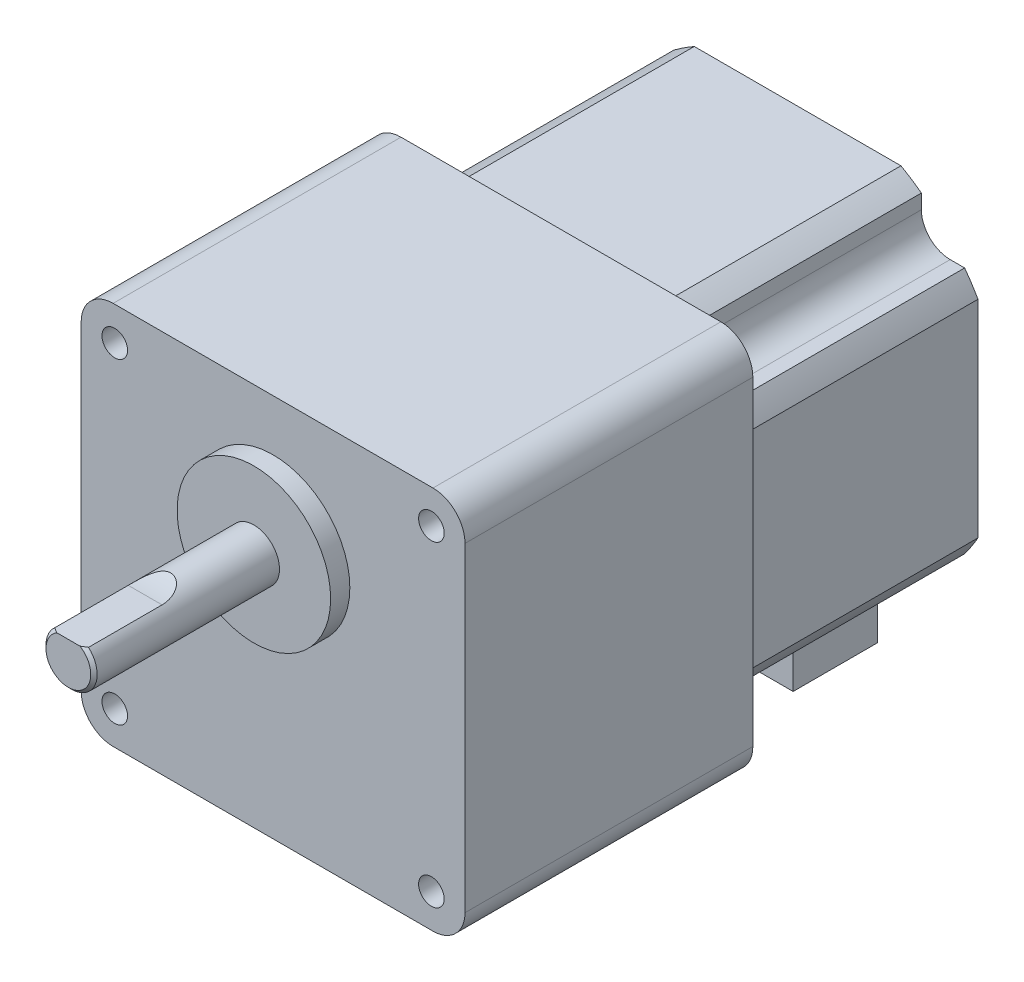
ISO-10303-21;
HEADER;
FILE_DESCRIPTION(('STEP AP214'),'2;1');
FILE_NAME('part.step','',(''),(''),'','','');
FILE_SCHEMA(('AUTOMOTIVE_DESIGN { 1 0 10303 214 1 1 1 1 }'));
ENDSEC;
DATA;
#1=APPLICATION_CONTEXT('core data for automotive mechanical design processes');
#2=APPLICATION_PROTOCOL_DEFINITION('international standard','automotive_design',2000,#1);
#3=PRODUCT_CONTEXT('',#1,'mechanical');
#4=PRODUCT('Part','Part','',(#3));
#5=PRODUCT_RELATED_PRODUCT_CATEGORY('part','',(#4));
#6=PRODUCT_DEFINITION_FORMATION('','',#4);
#7=PRODUCT_DEFINITION_CONTEXT('part definition',#1,'design');
#8=PRODUCT_DEFINITION('design','',#6,#7);
#9=PRODUCT_DEFINITION_SHAPE('','',#8);
#10=(LENGTH_UNIT() NAMED_UNIT(*) SI_UNIT(.MILLI.,.METRE.));
#11=(NAMED_UNIT(*) PLANE_ANGLE_UNIT() SI_UNIT($,.RADIAN.));
#12=(NAMED_UNIT(*) SI_UNIT($,.STERADIAN.) SOLID_ANGLE_UNIT());
#13=UNCERTAINTY_MEASURE_WITH_UNIT(LENGTH_MEASURE(1.E-05),#10,'distance_accuracy_value','');
#14=(GEOMETRIC_REPRESENTATION_CONTEXT(3) GLOBAL_UNCERTAINTY_ASSIGNED_CONTEXT((#13)) GLOBAL_UNIT_ASSIGNED_CONTEXT((#10,
#11,#12)) REPRESENTATION_CONTEXT('',''));
#15=CARTESIAN_POINT('',(0.,0.,0.));
#16=DIRECTION('',(0.,0.,1.));
#17=DIRECTION('',(1.,0.,0.));
#18=AXIS2_PLACEMENT_3D('',#15,#16,#17);
#19=CARTESIAN_POINT('',(-12.5,-48.2,-82.));
#20=DIRECTION('',(1.,0.,0.));
#21=DIRECTION('',(0.,0.,-1.));
#22=AXIS2_PLACEMENT_3D('',#19,#20,#21);
#23=PLANE('',#22);
#24=DIRECTION('',(0.,0.,-1.));
#25=VECTOR('',#24,1.);
#26=CARTESIAN_POINT('',(-12.5,-38.2,-82.));
#27=LINE('',#26,#25);
#28=CARTESIAN_POINT('',(-12.5,-38.2,-68.8));
#29=VERTEX_POINT('',#28);
#30=CARTESIAN_POINT('',(-12.5,-38.2,-82.));
#31=VERTEX_POINT('',#30);
#32=EDGE_CURVE('E112',#29,#31,#27,.T.);
#33=ORIENTED_EDGE('',*,*,#32,.T.);
#34=DIRECTION('',(0.,1.,0.));
#35=VECTOR('',#34,1.);
#36=CARTESIAN_POINT('',(-12.5,-48.2,-82.));
#37=LINE('',#36,#35);
#38=CARTESIAN_POINT('',(-12.5,-48.2,-82.));
#39=VERTEX_POINT('',#38);
#40=EDGE_CURVE('E13',#39,#31,#37,.T.);
#41=ORIENTED_EDGE('',*,*,#40,.F.);
#42=DIRECTION('',(0.,0.,-1.));
#43=VECTOR('',#42,1.);
#44=CARTESIAN_POINT('',(-12.5,-48.2,-82.));
#45=LINE('',#44,#43);
#46=CARTESIAN_POINT('',(-12.5,-48.2,-68.8));
#47=VERTEX_POINT('',#46);
#48=EDGE_CURVE('E100',#47,#39,#45,.T.);
#49=ORIENTED_EDGE('',*,*,#48,.F.);
#50=DIRECTION('',(0.,1.,0.));
#51=VECTOR('',#50,1.);
#52=CARTESIAN_POINT('',(-12.5,-48.2,-68.8));
#53=LINE('',#52,#51);
#54=EDGE_CURVE('E108',#47,#29,#53,.T.);
#55=ORIENTED_EDGE('',*,*,#54,.T.);
#56=EDGE_LOOP('',(#33,#41,#49,#55));
#57=FACE_BOUND('',#56,.T.);
#58=ADVANCED_FACE('F49',(#57),#23,.F.);
#59=CARTESIAN_POINT('',(-12.5,-48.2,-82.));
#60=DIRECTION('',(0.,0.,1.));
#61=DIRECTION('',(1.,0.,0.));
#62=AXIS2_PLACEMENT_3D('',#59,#60,#61);
#63=PLANE('',#62);
#64=DIRECTION('',(1.,0.,0.));
#65=VECTOR('',#64,1.);
#66=CARTESIAN_POINT('',(-12.5,-38.2,-82.));
#67=LINE('',#66,#65);
#68=CARTESIAN_POINT('',(12.5,-38.2,-82.));
#69=VERTEX_POINT('',#68);
#70=EDGE_CURVE('E104',#31,#69,#67,.T.);
#71=ORIENTED_EDGE('',*,*,#70,.T.);
#72=DIRECTION('',(0.,1.,0.));
#73=VECTOR('',#72,1.);
#74=CARTESIAN_POINT('',(12.5,-48.2,-82.));
#75=LINE('',#74,#73);
#76=CARTESIAN_POINT('',(12.5,-48.2,-82.));
#77=VERTEX_POINT('',#76);
#78=EDGE_CURVE('E57',#77,#69,#75,.T.);
#79=ORIENTED_EDGE('',*,*,#78,.F.);
#80=DIRECTION('',(1.,0.,0.));
#81=VECTOR('',#80,1.);
#82=CARTESIAN_POINT('',(-12.5,-48.2,-82.));
#83=LINE('',#82,#81);
#84=EDGE_CURVE('E95',#39,#77,#83,.T.);
#85=ORIENTED_EDGE('',*,*,#84,.F.);
#86=ORIENTED_EDGE('',*,*,#40,.T.);
#87=EDGE_LOOP('',(#71,#79,#85,#86));
#88=FACE_BOUND('',#87,.T.);
#89=ADVANCED_FACE('F103',(#88),#63,.F.);
#90=CARTESIAN_POINT('',(12.5,-48.2,-82.));
#91=DIRECTION('',(-1.,0.,0.));
#92=DIRECTION('',(0.,0.,1.));
#93=AXIS2_PLACEMENT_3D('',#90,#91,#92);
#94=PLANE('',#93);
#95=DIRECTION('',(0.,0.,1.));
#96=VECTOR('',#95,1.);
#97=CARTESIAN_POINT('',(12.5,-38.2,-82.));
#98=LINE('',#97,#96);
#99=CARTESIAN_POINT('',(12.5,-38.2,-68.8));
#100=VERTEX_POINT('',#99);
#101=EDGE_CURVE('E82',#69,#100,#98,.T.);
#102=ORIENTED_EDGE('',*,*,#101,.T.);
#103=DIRECTION('',(0.,1.,0.));
#104=VECTOR('',#103,1.);
#105=CARTESIAN_POINT('',(12.5,-48.2,-68.8));
#106=LINE('',#105,#104);
#107=CARTESIAN_POINT('',(12.5,-48.2,-68.8));
#108=VERTEX_POINT('',#107);
#109=EDGE_CURVE('E105',#108,#100,#106,.T.);
#110=ORIENTED_EDGE('',*,*,#109,.F.);
#111=DIRECTION('',(0.,0.,1.));
#112=VECTOR('',#111,1.);
#113=CARTESIAN_POINT('',(12.5,-48.2,-82.));
#114=LINE('',#113,#112);
#115=EDGE_CURVE('E98',#77,#108,#114,.T.);
#116=ORIENTED_EDGE('',*,*,#115,.F.);
#117=ORIENTED_EDGE('',*,*,#78,.T.);
#118=EDGE_LOOP('',(#102,#110,#116,#117));
#119=FACE_BOUND('',#118,.T.);
#120=ADVANCED_FACE('F106',(#119),#94,.F.);
#121=CARTESIAN_POINT('',(-12.5,-48.2,-68.8));
#122=DIRECTION('',(0.,0.,-1.));
#123=DIRECTION('',(-1.,0.,0.));
#124=AXIS2_PLACEMENT_3D('',#121,#122,#123);
#125=PLANE('',#124);
#126=DIRECTION('',(-1.,0.,0.));
#127=VECTOR('',#126,1.);
#128=CARTESIAN_POINT('',(-12.5,-38.2,-68.8));
#129=LINE('',#128,#127);
#130=EDGE_CURVE('E88',#100,#29,#129,.T.);
#131=ORIENTED_EDGE('',*,*,#130,.T.);
#132=ORIENTED_EDGE('',*,*,#54,.F.);
#133=DIRECTION('',(-1.,0.,0.));
#134=VECTOR('',#133,1.);
#135=CARTESIAN_POINT('',(-12.5,-48.2,-68.8));
#136=LINE('',#135,#134);
#137=EDGE_CURVE('E65',#108,#47,#136,.T.);
#138=ORIENTED_EDGE('',*,*,#137,.F.);
#139=ORIENTED_EDGE('',*,*,#109,.T.);
#140=EDGE_LOOP('',(#131,#132,#138,#139));
#141=FACE_BOUND('',#140,.T.);
#142=ADVANCED_FACE('F119',(#141),#125,.F.);
#143=CARTESIAN_POINT('',(0.,-48.2,0.));
#144=DIRECTION('',(0.,1.,0.));
#145=DIRECTION('',(0.,0.,1.));
#146=AXIS2_PLACEMENT_3D('',#143,#144,#145);
#147=PLANE('',#146);
#148=ORIENTED_EDGE('',*,*,#48,.T.);
#149=ORIENTED_EDGE('',*,*,#84,.T.);
#150=ORIENTED_EDGE('',*,*,#115,.T.);
#151=ORIENTED_EDGE('',*,*,#137,.T.);
#152=EDGE_LOOP('',(#148,#149,#150,#151));
#153=FACE_BOUND('',#152,.T.);
#154=ADVANCED_FACE('F96',(#153),#147,.F.);
#155=CARTESIAN_POINT('',(0.,-38.2,0.));
#156=DIRECTION('',(0.,1.,0.));
#157=DIRECTION('',(0.,0.,1.));
#158=AXIS2_PLACEMENT_3D('',#155,#156,#157);
#159=PLANE('',#158);
#160=ORIENTED_EDGE('',*,*,#32,.F.);
#161=ORIENTED_EDGE('',*,*,#130,.F.);
#162=ORIENTED_EDGE('',*,*,#101,.F.);
#163=ORIENTED_EDGE('',*,*,#70,.F.);
#164=EDGE_LOOP('',(#160,#161,#162,#163));
#165=FACE_BOUND('',#164,.T.);
#166=ADVANCED_FACE('F122',(#165),#159,.T.);
#167=CLOSED_SHELL('',(#58,#89,#120,#142,#154,#166));
#168=MANIFOLD_SOLID_BREP('B2',#167);
#169=CARTESIAN_POINT('',(0.,0.,3.));
#170=DIRECTION('',(0.,0.,-1.));
#171=DIRECTION('',(-1.,0.,0.));
#172=AXIS2_PLACEMENT_3D('',#169,#170,#171);
#173=CYLINDRICAL_SURFACE('',#172,12.);
#174=CARTESIAN_POINT('',(0.,0.,3.));
#175=DIRECTION('',(0.,0.,1.));
#176=DIRECTION('',(1.,0.,0.));
#177=AXIS2_PLACEMENT_3D('',#174,#175,#176);
#178=CIRCLE('',#177,12.);
#179=CARTESIAN_POINT('',(12.,0.,3.));
#180=VERTEX_POINT('',#179);
#181=EDGE_CURVE('E498',#180,#180,#178,.T.);
#182=ORIENTED_EDGE('',*,*,#181,.F.);
#183=EDGE_LOOP('',(#182));
#184=FACE_BOUND('',#183,.T.);
#185=CARTESIAN_POINT('',(0.,0.,0.));
#186=DIRECTION('',(0.,0.,1.));
#187=DIRECTION('',(1.,0.,0.));
#188=AXIS2_PLACEMENT_3D('',#185,#186,#187);
#189=CIRCLE('',#188,12.);
#190=CARTESIAN_POINT('',(12.,0.,0.));
#191=VERTEX_POINT('',#190);
#192=EDGE_CURVE('E486',#191,#191,#189,.T.);
#193=ORIENTED_EDGE('',*,*,#192,.T.);
#194=EDGE_LOOP('',(#193));
#195=FACE_BOUND('',#194,.T.);
#196=ADVANCED_FACE('F172',(#184,#195),#173,.T.);
#197=CARTESIAN_POINT('',(0.,0.,3.));
#198=DIRECTION('',(0.,0.,1.));
#199=DIRECTION('',(1.,0.,0.));
#200=AXIS2_PLACEMENT_3D('',#197,#198,#199);
#201=PLANE('',#200);
#202=CARTESIAN_POINT('',(0.,0.,3.));
#203=DIRECTION('',(0.,0.,1.));
#204=DIRECTION('',(1.,0.,0.));
#205=AXIS2_PLACEMENT_3D('',#202,#203,#204);
#206=CIRCLE('',#205,4.);
#207=CARTESIAN_POINT('',(4.,0.,3.));
#208=VERTEX_POINT('',#207);
#209=EDGE_CURVE('E499',#208,#208,#206,.T.);
#210=ORIENTED_EDGE('',*,*,#209,.F.);
#211=EDGE_LOOP('',(#210));
#212=FACE_BOUND('',#211,.T.);
#213=ORIENTED_EDGE('',*,*,#181,.T.);
#214=EDGE_LOOP('',(#213));
#215=FACE_BOUND('',#214,.T.);
#216=ADVANCED_FACE('F552',(#212,#215),#201,.T.);
#217=CARTESIAN_POINT('',(0.,0.,32.));
#218=DIRECTION('',(0.,0.,-1.));
#219=DIRECTION('',(-1.,0.,0.));
#220=AXIS2_PLACEMENT_3D('',#217,#218,#219);
#221=CYLINDRICAL_SURFACE('',#220,4.);
#222=CARTESIAN_POINT('',(0.,0.,31.5));
#223=DIRECTION('',(0.,0.,1.));
#224=DIRECTION('',(1.,0.,0.));
#225=AXIS2_PLACEMENT_3D('',#222,#223,#224);
#226=CIRCLE('',#225,4.);
#227=CARTESIAN_POINT('',(2.64575131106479,3.,31.5));
#228=VERTEX_POINT('',#227);
#229=CARTESIAN_POINT('',(-2.6457513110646,3.,31.5));
#230=VERTEX_POINT('',#229);
#231=EDGE_CURVE('E509',#228,#230,#226,.F.);
#232=ORIENTED_EDGE('',*,*,#231,.T.);
#233=DIRECTION('',(0.,0.,-1.));
#234=VECTOR('',#233,1.);
#235=CARTESIAN_POINT('',(-2.64575131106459,3.,32.));
#236=LINE('',#235,#234);
#237=CARTESIAN_POINT('',(-2.64575131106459,3.,20.));
#238=VERTEX_POINT('',#237);
#239=EDGE_CURVE('E495',#230,#238,#236,.T.);
#240=ORIENTED_EDGE('',*,*,#239,.T.);
#241=CARTESIAN_POINT('',(-2.64575131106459,3.,20.));
#242=CARTESIAN_POINT('',(-2.64574586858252,2.99999908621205,19.915243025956));
#243=CARTESIAN_POINT('',(-2.64431426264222,3.00126819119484,19.8304982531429));
#244=CARTESIAN_POINT('',(-2.63855647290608,3.00633339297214,19.6611750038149));
#245=CARTESIAN_POINT('',(-2.63423001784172,3.01012972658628,19.5765965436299));
#246=CARTESIAN_POINT('',(-2.61682033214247,3.02531148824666,19.3229823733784));
#247=CARTESIAN_POINT('',(-2.59930641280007,3.04048959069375,19.1544356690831));
#248=CARTESIAN_POINT('',(-2.55139380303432,3.08080825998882,18.8183944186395));
#249=CARTESIAN_POINT('',(-2.52084927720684,3.1060613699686,18.6509342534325));
#250=CARTESIAN_POINT('',(-2.4454378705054,3.16577982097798,18.3210791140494));
#251=CARTESIAN_POINT('',(-2.40058932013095,3.20023336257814,18.1586779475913));
#252=CARTESIAN_POINT('',(-2.31746041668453,3.26048157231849,17.9097880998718));
#253=CARTESIAN_POINT('',(-2.28469563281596,3.28359802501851,17.8207796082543));
#254=CARTESIAN_POINT('',(-2.2134415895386,3.33204718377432,17.6456877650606));
#255=CARTESIAN_POINT('',(-2.17495257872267,3.35737979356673,17.5596042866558));
#256=CARTESIAN_POINT('',(-2.09194107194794,3.40971844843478,17.391346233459));
#257=CARTESIAN_POINT('',(-2.04744226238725,3.43671770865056,17.3091579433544));
#258=CARTESIAN_POINT('',(-1.95185752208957,3.49188974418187,17.1491508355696));
#259=CARTESIAN_POINT('',(-1.90077328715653,3.52006221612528,17.07133090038));
#260=CARTESIAN_POINT('',(-1.76292503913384,3.59178487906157,16.8814941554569));
#261=CARTESIAN_POINT('',(-1.67148504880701,3.63566248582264,16.7729090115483));
#262=CARTESIAN_POINT('',(-1.47129303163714,3.72116740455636,16.5719254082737));
#263=CARTESIAN_POINT('',(-1.36255778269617,3.7627968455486,16.4795114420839));
#264=CARTESIAN_POINT('',(-1.15089494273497,3.832143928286,16.3312996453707));
#265=CARTESIAN_POINT('',(-1.05089172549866,3.86099619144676,16.2718773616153));
#266=CARTESIAN_POINT('',(-0.841299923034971,3.91200906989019,16.1691127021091));
#267=CARTESIAN_POINT('',(-0.731715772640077,3.93417276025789,16.1257629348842));
#268=CARTESIAN_POINT('',(-0.504833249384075,3.96968368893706,16.0571755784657));
#269=CARTESIAN_POINT('',(-0.387491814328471,3.98297620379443,16.0320503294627));
#270=CARTESIAN_POINT('',(-0.149548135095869,3.99897769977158,16.0018784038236));
#271=CARTESIAN_POINT('',(-0.0289474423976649,4.00169163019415,15.9968223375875));
#272=CARTESIAN_POINT('',(0.198670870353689,3.99651694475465,16.0065371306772));
#273=CARTESIAN_POINT('',(0.305805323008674,3.98969406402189,16.0193148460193));
#274=CARTESIAN_POINT('',(0.516124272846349,3.9679709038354,16.0605742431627));
#275=CARTESIAN_POINT('',(0.619308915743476,3.95307092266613,16.0890553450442));
#276=CARTESIAN_POINT('',(0.820147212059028,3.91636153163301,16.1607236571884));
#277=CARTESIAN_POINT('',(0.917742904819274,3.89449130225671,16.20404057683));
#278=CARTESIAN_POINT('',(1.10470962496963,3.84564343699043,16.3035290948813));
#279=CARTESIAN_POINT('',(1.19407701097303,3.81866355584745,16.3597063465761));
#280=CARTESIAN_POINT('',(1.39900220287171,3.74951515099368,16.5086981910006));
#281=CARTESIAN_POINT('',(1.5099939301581,3.70569653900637,16.6070330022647));
#282=CARTESIAN_POINT('',(1.71340644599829,3.61616731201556,16.8205970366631));
#283=CARTESIAN_POINT('',(1.80579482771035,3.57045355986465,16.9358551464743));
#284=CARTESIAN_POINT('',(1.94750864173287,3.49450021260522,17.1416603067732));
#285=CARTESIAN_POINT('',(2.00136578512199,3.46380103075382,17.2289947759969));
#286=CARTESIAN_POINT('',(2.10130529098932,3.40410185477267,17.4085950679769));
#287=CARTESIAN_POINT('',(2.14738471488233,3.37510250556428,17.5008627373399));
#288=CARTESIAN_POINT('',(2.2325150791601,3.31940851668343,17.6896643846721));
#289=CARTESIAN_POINT('',(2.2715397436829,3.29272267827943,17.7862127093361));
#290=CARTESIAN_POINT('',(2.34297066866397,3.24228257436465,17.98248158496));
#291=CARTESIAN_POINT('',(2.37537507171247,3.21852913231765,18.082203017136));
#292=CARTESIAN_POINT('',(2.44716630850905,3.16452452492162,18.3290385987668));
#293=CARTESIAN_POINT('',(2.48325452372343,3.13607822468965,18.4775161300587));
#294=CARTESIAN_POINT('',(2.54411835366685,3.08690514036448,18.7780872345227));
#295=CARTESIAN_POINT('',(2.5688855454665,3.06618410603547,18.9301834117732));
#296=CARTESIAN_POINT('',(2.60782082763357,3.03313644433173,19.2348677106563));
#297=CARTESIAN_POINT('',(2.62210551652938,3.02071761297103,19.3874308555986));
#298=CARTESIAN_POINT('',(2.63632519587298,3.00829224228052,19.6168979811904));
#299=CARTESIAN_POINT('',(2.63986389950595,3.00518427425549,19.6934407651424));
#300=CARTESIAN_POINT('',(2.64457510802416,3.00103786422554,19.8466527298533));
#301=CARTESIAN_POINT('',(2.64574769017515,2.99999935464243,19.9233219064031));
#302=CARTESIAN_POINT('',(2.6457513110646,3.,20.));
#303=B_SPLINE_CURVE_WITH_KNOTS('',3,(#241,#242,#243,#244,#245,#246,#247,#248,#249,#250,#251,
#252,#253,#254,#255,#256,#257,#258,#259,#260,#261,#262,#263,#264,#265,#266,#267,#268,#269,#270,
#271,#272,#273,#274,#275,#276,#277,#278,#279,#280,#281,#282,#283,#284,#285,#286,#287,#288,#289,
#290,#291,#292,#293,#294,#295,#296,#297,#298,#299,#300,#301,#302),.UNSPECIFIED.,.F.,.F.,(4,2,2,
2,2,2,2,2,2,2,2,2,2,2,2,2,2,2,2,2,2,2,2,2,2,2,2,2,2,2,4),(0.,0.25422445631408,0.508472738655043,
1.01806859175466,1.53352384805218,2.04832118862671,2.34099478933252,2.63365568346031,
2.92519505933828,3.21665951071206,3.66074875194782,4.10440978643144,4.46250594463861,
4.82043721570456,5.18055653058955,5.54050733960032,5.86329486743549,6.18607047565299,
6.51174336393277,6.83755969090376,7.2988867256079,7.76101056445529,8.08190764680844,
8.40292570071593,8.72511581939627,9.04739620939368,9.51292785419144,9.97880529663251,
10.4394187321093,10.6694264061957,10.899426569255),.UNSPECIFIED.);
#304=CARTESIAN_POINT('',(2.6457513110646,3.,20.));
#305=VERTEX_POINT('',#304);
#306=EDGE_CURVE('E521',#238,#305,#303,.T.);
#307=ORIENTED_EDGE('',*,*,#306,.T.);
#308=DIRECTION('',(0.,0.,-1.));
#309=VECTOR('',#308,1.);
#310=CARTESIAN_POINT('',(2.64575131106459,3.,32.));
#311=LINE('',#310,#309);
#312=EDGE_CURVE('E490',#305,#228,#311,.F.);
#313=ORIENTED_EDGE('',*,*,#312,.T.);
#314=EDGE_LOOP('',(#232,#240,#307,#313));
#315=FACE_BOUND('',#314,.T.);
#316=ORIENTED_EDGE('',*,*,#209,.T.);
#317=EDGE_LOOP('',(#316));
#318=FACE_BOUND('',#317,.T.);
#319=ADVANCED_FACE('F547',(#315,#318),#221,.T.);
#320=CARTESIAN_POINT('',(0.,0.,32.));
#321=DIRECTION('',(0.,0.,1.));
#322=DIRECTION('',(1.,0.,0.));
#323=AXIS2_PLACEMENT_3D('',#320,#321,#322);
#324=PLANE('',#323);
#325=DIRECTION('',(1.,0.,0.));
#326=VECTOR('',#325,1.);
#327=CARTESIAN_POINT('',(-5.,3.,32.));
#328=LINE('',#327,#326);
#329=CARTESIAN_POINT('',(-1.80277563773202,3.,32.));
#330=VERTEX_POINT('',#329);
#331=CARTESIAN_POINT('',(1.80277563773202,3.,32.));
#332=VERTEX_POINT('',#331);
#333=EDGE_CURVE('E491',#330,#332,#328,.T.);
#334=ORIENTED_EDGE('',*,*,#333,.F.);
#335=CARTESIAN_POINT('',(0.,0.,32.));
#336=DIRECTION('',(0.,0.,1.));
#337=DIRECTION('',(1.,0.,0.));
#338=AXIS2_PLACEMENT_3D('',#335,#336,#337);
#339=CIRCLE('',#338,3.50000000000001);
#340=EDGE_CURVE('E502',#330,#332,#339,.T.);
#341=ORIENTED_EDGE('',*,*,#340,.T.);
#342=EDGE_LOOP('',(#334,#341));
#343=FACE_BOUND('',#342,.T.);
#344=ADVANCED_FACE('F545',(#343),#324,.T.);
#345=CARTESIAN_POINT('',(0.,0.,32.));
#346=DIRECTION('',(0.,0.,-1.));
#347=DIRECTION('',(-1.,0.,0.));
#348=AXIS2_PLACEMENT_3D('',#345,#346,#347);
#349=CONICAL_SURFACE('',#348,3.50000000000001,0.785398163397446);
#350=CARTESIAN_POINT('',(-8.28302183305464,3.,26.6904341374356));
#351=CARTESIAN_POINT('',(-8.15263782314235,3.,26.8130230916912));
#352=CARTESIAN_POINT('',(-8.02208863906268,3.,26.9354362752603));
#353=CARTESIAN_POINT('',(-7.76060607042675,3.,27.1798531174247));
#354=CARTESIAN_POINT('',(-7.62967268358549,3.,27.3018567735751));
#355=CARTESIAN_POINT('',(-7.23603089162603,3.,27.6673377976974));
#356=CARTESIAN_POINT('',(-6.97266649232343,3.,27.9101103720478));
#357=CARTESIAN_POINT('',(-6.43676879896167,3.,28.3993162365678));
#358=CARTESIAN_POINT('',(-6.1641742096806,3.,28.6456824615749));
#359=CARTESIAN_POINT('',(-5.61571358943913,3.,29.1344175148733));
#360=CARTESIAN_POINT('',(-5.3398497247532,3.,29.3767887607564));
#361=CARTESIAN_POINT('',(-4.92236718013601,3.,29.7359102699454));
#362=CARTESIAN_POINT('',(-4.78263021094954,3.,29.8548466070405));
#363=CARTESIAN_POINT('',(-4.50160854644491,3.,30.0908741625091));
#364=CARTESIAN_POINT('',(-4.36032388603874,3.,30.2079654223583));
#365=CARTESIAN_POINT('',(-4.07554252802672,3.,30.4400375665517));
#366=CARTESIAN_POINT('',(-3.93204187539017,3.,30.5550136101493));
#367=CARTESIAN_POINT('',(-3.64263049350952,3.,30.7818781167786));
#368=CARTESIAN_POINT('',(-3.49671997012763,3.,30.8937668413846));
#369=CARTESIAN_POINT('',(-3.20338019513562,3.,31.1122717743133));
#370=CARTESIAN_POINT('',(-3.05598330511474,3.,31.2189312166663));
#371=CARTESIAN_POINT('',(-2.75726797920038,3.,31.4267949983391));
#372=CARTESIAN_POINT('',(-2.60594795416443,3.,31.527997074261));
#373=CARTESIAN_POINT('',(-2.29890420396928,3.,31.7223206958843));
#374=CARTESIAN_POINT('',(-2.14319772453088,3.,31.8154692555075));
#375=CARTESIAN_POINT('',(-1.82570045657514,3.,31.9906338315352));
#376=CARTESIAN_POINT('',(-1.66391643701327,3.,32.0726617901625));
#377=CARTESIAN_POINT('',(-1.40716113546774,3.,32.187378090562));
#378=CARTESIAN_POINT('',(-1.31471880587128,3.,32.2257102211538));
#379=CARTESIAN_POINT('',(-1.12749448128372,3.,32.2962958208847));
#380=CARTESIAN_POINT('',(-1.03271209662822,3.,32.328548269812));
#381=CARTESIAN_POINT('',(-0.841475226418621,3.,32.3855486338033));
#382=CARTESIAN_POINT('',(-0.745033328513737,3.,32.4103382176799));
#383=CARTESIAN_POINT('',(-0.550338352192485,3.,32.4514219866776));
#384=CARTESIAN_POINT('',(-0.452085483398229,3.,32.4677171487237));
#385=CARTESIAN_POINT('',(-0.253114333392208,3.,32.4909828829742));
#386=CARTESIAN_POINT('',(-0.152380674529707,3.,32.4978246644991));
#387=CARTESIAN_POINT('',(0.0492562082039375,3.,32.5012891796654));
#388=CARTESIAN_POINT('',(0.150159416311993,3.,32.497912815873));
#389=CARTESIAN_POINT('',(0.351467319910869,3.,32.4811545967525));
#390=CARTESIAN_POINT('',(0.451869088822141,3.,32.4677382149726));
#391=CARTESIAN_POINT('',(0.651011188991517,3.,32.4317417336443));
#392=CARTESIAN_POINT('',(0.749751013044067,3.,32.4091588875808));
#393=CARTESIAN_POINT('',(0.980292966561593,3.,32.3464916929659));
#394=CARTESIAN_POINT('',(1.11117205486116,3.,32.3030326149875));
#395=CARTESIAN_POINT('',(1.36855068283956,3.,32.2047393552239));
#396=CARTESIAN_POINT('',(1.49504768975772,3.,32.1498987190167));
#397=CARTESIAN_POINT('',(1.74534487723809,3.,32.0309999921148));
#398=CARTESIAN_POINT('',(1.86909821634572,3.,31.9668444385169));
#399=CARTESIAN_POINT('',(2.05195532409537,3.,31.8657251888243));
#400=CARTESIAN_POINT('',(2.11243803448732,3.,31.8312091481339));
#401=CARTESIAN_POINT('',(2.23256440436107,3.,31.7607515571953));
#402=CARTESIAN_POINT('',(2.29220810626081,3.,31.7248100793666));
#403=CARTESIAN_POINT('',(2.49748813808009,3.,31.598180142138));
#404=CARTESIAN_POINT('',(2.64119894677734,3.,31.5043665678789));
#405=CARTESIAN_POINT('',(2.92497771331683,3.,31.3113605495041));
#406=CARTESIAN_POINT('',(3.06504459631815,3.,31.2121665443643));
#407=CARTESIAN_POINT('',(3.34239530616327,3.,31.0097194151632));
#408=CARTESIAN_POINT('',(3.47967652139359,3.,30.9064627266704));
#409=CARTESIAN_POINT('',(3.75192700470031,3.,30.6969373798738));
#410=CARTESIAN_POINT('',(3.88689609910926,3.,30.5906684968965));
#411=CARTESIAN_POINT('',(4.15551430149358,3.,30.3753709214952));
#412=CARTESIAN_POINT('',(4.28915579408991,3.,30.2663327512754));
#413=CARTESIAN_POINT('',(4.55491091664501,3.,30.0464077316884));
#414=CARTESIAN_POINT('',(4.68702450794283,3.,29.935520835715));
#415=CARTESIAN_POINT('',(5.08134960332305,3.,29.6007890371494));
#416=CARTESIAN_POINT('',(5.34169738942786,3.,29.374749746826));
#417=CARTESIAN_POINT('',(5.82863336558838,3.,28.9455005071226));
#418=CARTESIAN_POINT('',(6.05560219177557,3.,28.7427196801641));
#419=CARTESIAN_POINT('',(6.5075562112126,3.,28.3348901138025));
#420=CARTESIAN_POINT('',(6.73254108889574,3.,28.1298410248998));
#421=CARTESIAN_POINT('',(7.17912974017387,3.,27.719760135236));
#422=CARTESIAN_POINT('',(7.40074610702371,3.,27.5147420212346));
#423=CARTESIAN_POINT('',(7.84273110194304,3.,27.1034510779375));
#424=CARTESIAN_POINT('',(8.06309996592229,3.,26.8971785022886));
#425=CARTESIAN_POINT('',(8.28302183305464,3.,26.6904341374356));
#426=B_SPLINE_CURVE_WITH_KNOTS('',3,(#350,#351,#352,#353,#354,#355,#356,#357,#358,#359,#360,
#361,#362,#363,#364,#365,#366,#367,#368,#369,#370,#371,#372,#373,#374,#375,#376,#377,#378,#379,
#380,#381,#382,#383,#384,#385,#386,#387,#388,#389,#390,#391,#392,#393,#394,#395,#396,#397,#398,
#399,#400,#401,#402,#403,#404,#405,#406,#407,#408,#409,#410,#411,#412,#413,#414,#415,#416,#417,
#418,#419,#420,#421,#422,#423,#424,#425),.UNSPECIFIED.,.F.,.F.,(4,2,2,2,2,2,2,2,2,2,2,2,2,2,2,2,
2,2,2,2,2,2,2,2,2,2,2,2,2,2,2,2,2,2,2,2,2,4),(0.,0.536890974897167,1.07378514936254,
2.14833853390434,3.25060478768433,4.35217750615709,4.90266582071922,5.45314174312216,
6.0047508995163,6.55631317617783,7.10204462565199,7.6480006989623,8.19204801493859,
8.73550637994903,9.03556246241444,9.33566885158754,9.63406712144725,9.93243106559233,
10.2348210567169,10.5371843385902,10.8405922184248,11.1440910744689,11.5570788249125,
11.9703014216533,12.3882094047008,12.5971103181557,12.8060006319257,13.3206701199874,
13.8354897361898,14.350771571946,14.8660919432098,15.3835112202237,15.9009435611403,
16.9352213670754,17.84828587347,18.761493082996,19.6672008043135,20.5727311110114),.UNSPECIFIED.);
#427=EDGE_CURVE('E520',#230,#330,#426,.T.);
#428=ORIENTED_EDGE('',*,*,#427,.F.);
#429=ORIENTED_EDGE('',*,*,#231,.F.);
#430=EDGE_CURVE('E512',#332,#228,#426,.T.);
#431=ORIENTED_EDGE('',*,*,#430,.F.);
#432=ORIENTED_EDGE('',*,*,#340,.F.);
#433=EDGE_LOOP('',(#428,#429,#431,#432));
#434=FACE_BOUND('',#433,.T.);
#435=ADVANCED_FACE('F529',(#434),#349,.T.);
#436=CARTESIAN_POINT('',(-5.,11.5,20.));
#437=DIRECTION('',(1.,0.,0.));
#438=DIRECTION('',(0.,0.,-1.));
#439=AXIS2_PLACEMENT_3D('',#436,#437,#438);
#440=CYLINDRICAL_SURFACE('',#439,8.49999999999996);
#441=DIRECTION('',(1.,0.,0.));
#442=VECTOR('',#441,1.);
#443=CARTESIAN_POINT('',(-5.,3.,20.));
#444=LINE('',#443,#442);
#445=EDGE_CURVE('E487',#238,#305,#444,.T.);
#446=ORIENTED_EDGE('',*,*,#445,.T.);
#447=ORIENTED_EDGE('',*,*,#306,.F.);
#448=EDGE_LOOP('',(#446,#447));
#449=FACE_BOUND('',#448,.T.);
#450=ADVANCED_FACE('F538',(#449),#440,.F.);
#451=CARTESIAN_POINT('',(-5.,3.,0.));
#452=DIRECTION('',(0.,-1.,0.));
#453=DIRECTION('',(0.,0.,-1.));
#454=AXIS2_PLACEMENT_3D('',#451,#452,#453);
#455=PLANE('',#454);
#456=ORIENTED_EDGE('',*,*,#427,.T.);
#457=ORIENTED_EDGE('',*,*,#333,.T.);
#458=ORIENTED_EDGE('',*,*,#430,.T.);
#459=ORIENTED_EDGE('',*,*,#312,.F.);
#460=ORIENTED_EDGE('',*,*,#445,.F.);
#461=ORIENTED_EDGE('',*,*,#239,.F.);
#462=EDGE_LOOP('',(#456,#457,#458,#459,#460,#461));
#463=FACE_BOUND('',#462,.T.);
#464=ADVANCED_FACE('F533',(#463),#455,.F.);
#465=CARTESIAN_POINT('',(-25.,-35.,-45.));
#466=DIRECTION('',(0.,0.,1.));
#467=DIRECTION('',(1.,0.,0.));
#468=AXIS2_PLACEMENT_3D('',#465,#466,#467);
#469=CYLINDRICAL_SURFACE('',#468,5.);
#470=CARTESIAN_POINT('',(-25.,-35.,0.));
#471=DIRECTION('',(0.,0.,-1.));
#472=DIRECTION('',(1.,0.,0.));
#473=AXIS2_PLACEMENT_3D('',#470,#471,#472);
#474=CIRCLE('',#473,5.);
#475=CARTESIAN_POINT('',(-25.,-40.,0.));
#476=VERTEX_POINT('',#475);
#477=CARTESIAN_POINT('',(-30.,-35.,0.));
#478=VERTEX_POINT('',#477);
#479=EDGE_CURVE('E423',#476,#478,#474,.T.);
#480=ORIENTED_EDGE('',*,*,#479,.T.);
#481=DIRECTION('',(0.,0.,1.));
#482=VECTOR('',#481,1.);
#483=CARTESIAN_POINT('',(-30.,-35.,-45.));
#484=LINE('',#483,#482);
#485=CARTESIAN_POINT('',(-30.,-35.,-45.));
#486=VERTEX_POINT('',#485);
#487=EDGE_CURVE('E483',#486,#478,#484,.T.);
#488=ORIENTED_EDGE('',*,*,#487,.F.);
#489=CARTESIAN_POINT('',(-25.,-35.,-45.));
#490=DIRECTION('',(0.,0.,-1.));
#491=DIRECTION('',(1.,0.,0.));
#492=AXIS2_PLACEMENT_3D('',#489,#490,#491);
#493=CIRCLE('',#492,5.);
#494=CARTESIAN_POINT('',(-25.,-40.,-45.));
#495=VERTEX_POINT('',#494);
#496=EDGE_CURVE('E432',#495,#486,#493,.T.);
#497=ORIENTED_EDGE('',*,*,#496,.F.);
#498=DIRECTION('',(0.,0.,1.));
#499=VECTOR('',#498,1.);
#500=CARTESIAN_POINT('',(-25.,-40.,-45.));
#501=LINE('',#500,#499);
#502=EDGE_CURVE('E449',#495,#476,#501,.T.);
#503=ORIENTED_EDGE('',*,*,#502,.T.);
#504=EDGE_LOOP('',(#480,#488,#497,#503));
#505=FACE_BOUND('',#504,.T.);
#506=ADVANCED_FACE('F537',(#505),#469,.T.);
#507=CARTESIAN_POINT('',(-30.,-35.,-45.));
#508=DIRECTION('',(1.,0.,0.));
#509=DIRECTION('',(0.,0.,-1.));
#510=AXIS2_PLACEMENT_3D('',#507,#508,#509);
#511=PLANE('',#510);
#512=DIRECTION('',(0.,1.,0.));
#513=VECTOR('',#512,1.);
#514=CARTESIAN_POINT('',(-30.,-35.,0.));
#515=LINE('',#514,#513);
#516=CARTESIAN_POINT('',(-30.,15.,0.));
#517=VERTEX_POINT('',#516);
#518=EDGE_CURVE('E426',#478,#517,#515,.T.);
#519=ORIENTED_EDGE('',*,*,#518,.T.);
#520=DIRECTION('',(0.,0.,1.));
#521=VECTOR('',#520,1.);
#522=CARTESIAN_POINT('',(-30.,15.,-45.));
#523=LINE('',#522,#521);
#524=CARTESIAN_POINT('',(-30.,15.,-45.));
#525=VERTEX_POINT('',#524);
#526=EDGE_CURVE('E480',#525,#517,#523,.T.);
#527=ORIENTED_EDGE('',*,*,#526,.F.);
#528=DIRECTION('',(0.,1.,0.));
#529=VECTOR('',#528,1.);
#530=CARTESIAN_POINT('',(-30.,-35.,-45.));
#531=LINE('',#530,#529);
#532=EDGE_CURVE('E435',#486,#525,#531,.T.);
#533=ORIENTED_EDGE('',*,*,#532,.F.);
#534=ORIENTED_EDGE('',*,*,#487,.T.);
#535=EDGE_LOOP('',(#519,#527,#533,#534));
#536=FACE_BOUND('',#535,.T.);
#537=ADVANCED_FACE('F606',(#536),#511,.F.);
#538=CARTESIAN_POINT('',(-25.,15.,-45.));
#539=DIRECTION('',(0.,0.,1.));
#540=DIRECTION('',(1.,0.,0.));
#541=AXIS2_PLACEMENT_3D('',#538,#539,#540);
#542=CYLINDRICAL_SURFACE('',#541,5.);
#543=CARTESIAN_POINT('',(-25.,15.,0.));
#544=DIRECTION('',(0.,0.,-1.));
#545=DIRECTION('',(-1.,0.,0.));
#546=AXIS2_PLACEMENT_3D('',#543,#544,#545);
#547=CIRCLE('',#546,5.);
#548=CARTESIAN_POINT('',(-25.,20.,0.));
#549=VERTEX_POINT('',#548);
#550=EDGE_CURVE('E452',#517,#549,#547,.T.);
#551=ORIENTED_EDGE('',*,*,#550,.T.);
#552=DIRECTION('',(0.,0.,1.));
#553=VECTOR('',#552,1.);
#554=CARTESIAN_POINT('',(-25.,20.,-45.));
#555=LINE('',#554,#553);
#556=CARTESIAN_POINT('',(-25.,20.,-45.));
#557=VERTEX_POINT('',#556);
#558=EDGE_CURVE('E477',#557,#549,#555,.T.);
#559=ORIENTED_EDGE('',*,*,#558,.F.);
#560=CARTESIAN_POINT('',(-25.,15.,-45.));
#561=DIRECTION('',(0.,0.,-1.));
#562=DIRECTION('',(-1.,0.,0.));
#563=AXIS2_PLACEMENT_3D('',#560,#561,#562);
#564=CIRCLE('',#563,5.);
#565=EDGE_CURVE('E438',#525,#557,#564,.T.);
#566=ORIENTED_EDGE('',*,*,#565,.F.);
#567=ORIENTED_EDGE('',*,*,#526,.T.);
#568=EDGE_LOOP('',(#551,#559,#566,#567));
#569=FACE_BOUND('',#568,.T.);
#570=ADVANCED_FACE('F602',(#569),#542,.T.);
#571=CARTESIAN_POINT('',(25.,20.,-45.));
#572=DIRECTION('',(0.,-1.,0.));
#573=DIRECTION('',(0.,0.,-1.));
#574=AXIS2_PLACEMENT_3D('',#571,#572,#573);
#575=PLANE('',#574);
#576=DIRECTION('',(1.,0.,0.));
#577=VECTOR('',#576,1.);
#578=CARTESIAN_POINT('',(25.,20.,0.));
#579=LINE('',#578,#577);
#580=CARTESIAN_POINT('',(25.,20.,0.));
#581=VERTEX_POINT('',#580);
#582=EDGE_CURVE('E454',#549,#581,#579,.T.);
#583=ORIENTED_EDGE('',*,*,#582,.T.);
#584=DIRECTION('',(0.,0.,1.));
#585=VECTOR('',#584,1.);
#586=CARTESIAN_POINT('',(25.,20.,-45.));
#587=LINE('',#586,#585);
#588=CARTESIAN_POINT('',(25.,20.,-45.));
#589=VERTEX_POINT('',#588);
#590=EDGE_CURVE('E474',#589,#581,#587,.T.);
#591=ORIENTED_EDGE('',*,*,#590,.F.);
#592=DIRECTION('',(1.,0.,0.));
#593=VECTOR('',#592,1.);
#594=CARTESIAN_POINT('',(25.,20.,-45.));
#595=LINE('',#594,#593);
#596=EDGE_CURVE('E440',#557,#589,#595,.T.);
#597=ORIENTED_EDGE('',*,*,#596,.F.);
#598=ORIENTED_EDGE('',*,*,#558,.T.);
#599=EDGE_LOOP('',(#583,#591,#597,#598));
#600=FACE_BOUND('',#599,.T.);
#601=ADVANCED_FACE('F599',(#600),#575,.F.);
#602=CARTESIAN_POINT('',(25.,15.,-45.));
#603=DIRECTION('',(0.,0.,1.));
#604=DIRECTION('',(1.,0.,0.));
#605=AXIS2_PLACEMENT_3D('',#602,#603,#604);
#606=CYLINDRICAL_SURFACE('',#605,5.);
#607=CARTESIAN_POINT('',(25.,15.,0.));
#608=DIRECTION('',(0.,0.,-1.));
#609=DIRECTION('',(-1.,0.,0.));
#610=AXIS2_PLACEMENT_3D('',#607,#608,#609);
#611=CIRCLE('',#610,5.);
#612=CARTESIAN_POINT('',(30.,15.,0.));
#613=VERTEX_POINT('',#612);
#614=EDGE_CURVE('E456',#581,#613,#611,.T.);
#615=ORIENTED_EDGE('',*,*,#614,.T.);
#616=DIRECTION('',(0.,0.,1.));
#617=VECTOR('',#616,1.);
#618=CARTESIAN_POINT('',(30.,15.,-45.));
#619=LINE('',#618,#617);
#620=CARTESIAN_POINT('',(30.,15.,-45.));
#621=VERTEX_POINT('',#620);
#622=EDGE_CURVE('E471',#621,#613,#619,.T.);
#623=ORIENTED_EDGE('',*,*,#622,.F.);
#624=CARTESIAN_POINT('',(25.,15.,-45.));
#625=DIRECTION('',(0.,0.,-1.));
#626=DIRECTION('',(-1.,0.,0.));
#627=AXIS2_PLACEMENT_3D('',#624,#625,#626);
#628=CIRCLE('',#627,5.);
#629=EDGE_CURVE('E442',#589,#621,#628,.T.);
#630=ORIENTED_EDGE('',*,*,#629,.F.);
#631=ORIENTED_EDGE('',*,*,#590,.T.);
#632=EDGE_LOOP('',(#615,#623,#630,#631));
#633=FACE_BOUND('',#632,.T.);
#634=ADVANCED_FACE('F595',(#633),#606,.T.);
#635=CARTESIAN_POINT('',(30.,-35.,-45.));
#636=DIRECTION('',(-1.,0.,0.));
#637=DIRECTION('',(0.,0.,1.));
#638=AXIS2_PLACEMENT_3D('',#635,#636,#637);
#639=PLANE('',#638);
#640=DIRECTION('',(0.,-1.,0.));
#641=VECTOR('',#640,1.);
#642=CARTESIAN_POINT('',(30.,-35.,0.));
#643=LINE('',#642,#641);
#644=CARTESIAN_POINT('',(30.,-35.,0.));
#645=VERTEX_POINT('',#644);
#646=EDGE_CURVE('E458',#613,#645,#643,.T.);
#647=ORIENTED_EDGE('',*,*,#646,.T.);
#648=DIRECTION('',(0.,0.,1.));
#649=VECTOR('',#648,1.);
#650=CARTESIAN_POINT('',(30.,-35.,-45.));
#651=LINE('',#650,#649);
#652=CARTESIAN_POINT('',(30.,-35.,-45.));
#653=VERTEX_POINT('',#652);
#654=EDGE_CURVE('E468',#653,#645,#651,.T.);
#655=ORIENTED_EDGE('',*,*,#654,.F.);
#656=DIRECTION('',(0.,-1.,0.));
#657=VECTOR('',#656,1.);
#658=CARTESIAN_POINT('',(30.,-35.,-45.));
#659=LINE('',#658,#657);
#660=EDGE_CURVE('E444',#621,#653,#659,.T.);
#661=ORIENTED_EDGE('',*,*,#660,.F.);
#662=ORIENTED_EDGE('',*,*,#622,.T.);
#663=EDGE_LOOP('',(#647,#655,#661,#662));
#664=FACE_BOUND('',#663,.T.);
#665=ADVANCED_FACE('F590',(#664),#639,.F.);
#666=CARTESIAN_POINT('',(25.,-35.,-45.));
#667=DIRECTION('',(0.,0.,1.));
#668=DIRECTION('',(1.,0.,0.));
#669=AXIS2_PLACEMENT_3D('',#666,#667,#668);
#670=CYLINDRICAL_SURFACE('',#669,5.);
#671=CARTESIAN_POINT('',(25.,-35.,0.));
#672=DIRECTION('',(0.,0.,-1.));
#673=DIRECTION('',(1.,0.,0.));
#674=AXIS2_PLACEMENT_3D('',#671,#672,#673);
#675=CIRCLE('',#674,5.);
#676=CARTESIAN_POINT('',(25.,-40.,0.));
#677=VERTEX_POINT('',#676);
#678=EDGE_CURVE('E460',#645,#677,#675,.T.);
#679=ORIENTED_EDGE('',*,*,#678,.T.);
#680=DIRECTION('',(0.,0.,1.));
#681=VECTOR('',#680,1.);
#682=CARTESIAN_POINT('',(25.,-40.,-45.));
#683=LINE('',#682,#681);
#684=CARTESIAN_POINT('',(25.,-40.,-45.));
#685=VERTEX_POINT('',#684);
#686=EDGE_CURVE('E465',#685,#677,#683,.T.);
#687=ORIENTED_EDGE('',*,*,#686,.F.);
#688=CARTESIAN_POINT('',(25.,-35.,-45.));
#689=DIRECTION('',(0.,0.,-1.));
#690=DIRECTION('',(1.,0.,0.));
#691=AXIS2_PLACEMENT_3D('',#688,#689,#690);
#692=CIRCLE('',#691,5.);
#693=EDGE_CURVE('E446',#653,#685,#692,.T.);
#694=ORIENTED_EDGE('',*,*,#693,.F.);
#695=ORIENTED_EDGE('',*,*,#654,.T.);
#696=EDGE_LOOP('',(#679,#687,#694,#695));
#697=FACE_BOUND('',#696,.T.);
#698=ADVANCED_FACE('F584',(#697),#670,.T.);
#699=CARTESIAN_POINT('',(25.,-40.,-45.));
#700=DIRECTION('',(0.,1.,0.));
#701=DIRECTION('',(0.,0.,1.));
#702=AXIS2_PLACEMENT_3D('',#699,#700,#701);
#703=PLANE('',#702);
#704=DIRECTION('',(-1.,0.,0.));
#705=VECTOR('',#704,1.);
#706=CARTESIAN_POINT('',(25.,-40.,0.));
#707=LINE('',#706,#705);
#708=EDGE_CURVE('E436',#677,#476,#707,.T.);
#709=ORIENTED_EDGE('',*,*,#708,.T.);
#710=ORIENTED_EDGE('',*,*,#502,.F.);
#711=DIRECTION('',(-1.,0.,0.));
#712=VECTOR('',#711,1.);
#713=CARTESIAN_POINT('',(25.,-40.,-45.));
#714=LINE('',#713,#712);
#715=EDGE_CURVE('E448',#685,#495,#714,.T.);
#716=ORIENTED_EDGE('',*,*,#715,.F.);
#717=ORIENTED_EDGE('',*,*,#686,.T.);
#718=EDGE_LOOP('',(#709,#710,#716,#717));
#719=FACE_BOUND('',#718,.T.);
#720=ADVANCED_FACE('F580',(#719),#703,.F.);
#721=CARTESIAN_POINT('',(-25.,-35.,-45.));
#722=DIRECTION('',(0.,0.,1.));
#723=DIRECTION('',(1.,0.,0.));
#724=AXIS2_PLACEMENT_3D('',#721,#722,#723);
#725=PLANE('',#724);
#726=DIRECTION('',(0.,-1.,0.));
#727=VECTOR('',#726,1.);
#728=CARTESIAN_POINT('',(19.35,0.,-45.));
#729=LINE('',#728,#727);
#730=CARTESIAN_POINT('',(19.35,-33.85,-45.));
#731=VERTEX_POINT('',#730);
#732=CARTESIAN_POINT('',(19.35,-36.1118268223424,-45.));
#733=VERTEX_POINT('',#732);
#734=EDGE_CURVE('E1109',#731,#733,#729,.T.);
#735=ORIENTED_EDGE('',*,*,#734,.F.);
#736=CARTESIAN_POINT('',(23.85,-33.85,-45.));
#737=DIRECTION('',(0.,0.,1.));
#738=DIRECTION('',(1.,0.,0.));
#739=AXIS2_PLACEMENT_3D('',#736,#737,#738);
#740=CIRCLE('',#739,4.5);
#741=CARTESIAN_POINT('',(23.85,-29.35,-45.));
#742=VERTEX_POINT('',#741);
#743=EDGE_CURVE('E1187',#731,#742,#740,.F.);
#744=ORIENTED_EDGE('',*,*,#743,.T.);
#745=DIRECTION('',(1.,0.,0.));
#746=VECTOR('',#745,1.);
#747=CARTESIAN_POINT('',(0.,-29.35,-45.));
#748=LINE('',#747,#746);
#749=CARTESIAN_POINT('',(26.1118268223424,-29.35,-45.));
#750=VERTEX_POINT('',#749);
#751=EDGE_CURVE('E1107',#742,#750,#748,.T.);
#752=ORIENTED_EDGE('',*,*,#751,.T.);
#753=CARTESIAN_POINT('',(0.,-10.,-45.));
#754=DIRECTION('',(0.,0.,-1.));
#755=DIRECTION('',(-1.,0.,0.));
#756=AXIS2_PLACEMENT_3D('',#753,#754,#755);
#757=CIRCLE('',#756,32.5);
#758=CARTESIAN_POINT('',(28.2,-26.1558039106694,-45.));
#759=VERTEX_POINT('',#758);
#760=EDGE_CURVE('E1105',#759,#750,#757,.T.);
#761=ORIENTED_EDGE('',*,*,#760,.F.);
#762=DIRECTION('',(0.,1.,0.));
#763=VECTOR('',#762,1.);
#764=CARTESIAN_POINT('',(28.2,0.,-45.));
#765=LINE('',#764,#763);
#766=CARTESIAN_POINT('',(28.2,6.15580391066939,-45.));
#767=VERTEX_POINT('',#766);
#768=EDGE_CURVE('E1104',#759,#767,#765,.T.);
#769=ORIENTED_EDGE('',*,*,#768,.T.);
#770=CARTESIAN_POINT('',(26.1118268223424,9.35,-45.));
#771=VERTEX_POINT('',#770);
#772=EDGE_CURVE('E1102',#771,#767,#757,.T.);
#773=ORIENTED_EDGE('',*,*,#772,.F.);
#774=DIRECTION('',(1.,0.,0.));
#775=VECTOR('',#774,1.);
#776=CARTESIAN_POINT('',(0.,9.35000000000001,-45.));
#777=LINE('',#776,#775);
#778=CARTESIAN_POINT('',(23.85,9.35,-45.));
#779=VERTEX_POINT('',#778);
#780=EDGE_CURVE('E421',#779,#771,#777,.T.);
#781=ORIENTED_EDGE('',*,*,#780,.F.);
#782=CARTESIAN_POINT('',(23.85,13.85,-45.));
#783=DIRECTION('',(0.,0.,1.));
#784=DIRECTION('',(1.,0.,0.));
#785=AXIS2_PLACEMENT_3D('',#782,#783,#784);
#786=CIRCLE('',#785,4.5);
#787=CARTESIAN_POINT('',(19.35,13.85,-45.));
#788=VERTEX_POINT('',#787);
#789=EDGE_CURVE('E1220',#779,#788,#786,.F.);
#790=ORIENTED_EDGE('',*,*,#789,.T.);
#791=DIRECTION('',(0.,-1.,0.));
#792=VECTOR('',#791,1.);
#793=CARTESIAN_POINT('',(19.35,0.,-45.));
#794=LINE('',#793,#792);
#795=CARTESIAN_POINT('',(19.35,16.1118268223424,-45.));
#796=VERTEX_POINT('',#795);
#797=EDGE_CURVE('E406',#796,#788,#794,.T.);
#798=ORIENTED_EDGE('',*,*,#797,.F.);
#799=CARTESIAN_POINT('',(0.,-10.,-45.));
#800=DIRECTION('',(0.,0.,-1.));
#801=DIRECTION('',(-1.,0.,0.));
#802=AXIS2_PLACEMENT_3D('',#799,#800,#801);
#803=CIRCLE('',#802,32.5);
#804=CARTESIAN_POINT('',(16.1558039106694,18.2,-45.));
#805=VERTEX_POINT('',#804);
#806=EDGE_CURVE('E1140',#805,#796,#803,.T.);
#807=ORIENTED_EDGE('',*,*,#806,.F.);
#808=DIRECTION('',(-1.,0.,0.));
#809=VECTOR('',#808,1.);
#810=CARTESIAN_POINT('',(0.,18.2,-45.));
#811=LINE('',#810,#809);
#812=CARTESIAN_POINT('',(-16.1558039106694,18.2,-45.));
#813=VERTEX_POINT('',#812);
#814=EDGE_CURVE('E1139',#805,#813,#811,.T.);
#815=ORIENTED_EDGE('',*,*,#814,.T.);
#816=CARTESIAN_POINT('',(-19.35,16.1118268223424,-45.));
#817=VERTEX_POINT('',#816);
#818=EDGE_CURVE('E1136',#817,#813,#803,.T.);
#819=ORIENTED_EDGE('',*,*,#818,.F.);
#820=DIRECTION('',(0.,-1.,0.));
#821=VECTOR('',#820,1.);
#822=CARTESIAN_POINT('',(-19.35,0.,-45.));
#823=LINE('',#822,#821);
#824=CARTESIAN_POINT('',(-19.35,13.85,-45.));
#825=VERTEX_POINT('',#824);
#826=EDGE_CURVE('E1133',#817,#825,#823,.T.);
#827=ORIENTED_EDGE('',*,*,#826,.T.);
#828=CARTESIAN_POINT('',(-23.85,13.85,-45.));
#829=DIRECTION('',(0.,0.,1.));
#830=DIRECTION('',(1.,0.,0.));
#831=AXIS2_PLACEMENT_3D('',#828,#829,#830);
#832=CIRCLE('',#831,4.5);
#833=CARTESIAN_POINT('',(-23.85,9.35000000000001,-45.));
#834=VERTEX_POINT('',#833);
#835=EDGE_CURVE('E1212',#825,#834,#832,.F.);
#836=ORIENTED_EDGE('',*,*,#835,.T.);
#837=DIRECTION('',(1.,0.,0.));
#838=VECTOR('',#837,1.);
#839=CARTESIAN_POINT('',(0.,9.35000000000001,-45.));
#840=LINE('',#839,#838);
#841=CARTESIAN_POINT('',(-26.1118268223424,9.35000000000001,-45.));
#842=VERTEX_POINT('',#841);
#843=EDGE_CURVE('E1130',#842,#834,#840,.T.);
#844=ORIENTED_EDGE('',*,*,#843,.F.);
#845=CARTESIAN_POINT('',(0.,-10.,-45.));
#846=DIRECTION('',(0.,0.,-1.));
#847=DIRECTION('',(-1.,0.,0.));
#848=AXIS2_PLACEMENT_3D('',#845,#846,#847);
#849=CIRCLE('',#848,32.5);
#850=CARTESIAN_POINT('',(-28.2,6.1558039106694,-45.));
#851=VERTEX_POINT('',#850);
#852=EDGE_CURVE('E1127',#851,#842,#849,.T.);
#853=ORIENTED_EDGE('',*,*,#852,.F.);
#854=DIRECTION('',(0.,1.,0.));
#855=VECTOR('',#854,1.);
#856=CARTESIAN_POINT('',(-28.2,0.,-45.));
#857=LINE('',#856,#855);
#858=CARTESIAN_POINT('',(-28.2,-26.1558039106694,-45.));
#859=VERTEX_POINT('',#858);
#860=EDGE_CURVE('E1126',#859,#851,#857,.T.);
#861=ORIENTED_EDGE('',*,*,#860,.F.);
#862=CARTESIAN_POINT('',(-26.1118268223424,-29.35,-45.));
#863=VERTEX_POINT('',#862);
#864=EDGE_CURVE('E1123',#863,#859,#849,.T.);
#865=ORIENTED_EDGE('',*,*,#864,.F.);
#866=DIRECTION('',(1.,0.,0.));
#867=VECTOR('',#866,1.);
#868=CARTESIAN_POINT('',(0.,-29.35,-45.));
#869=LINE('',#868,#867);
#870=CARTESIAN_POINT('',(-23.85,-29.35,-45.));
#871=VERTEX_POINT('',#870);
#872=EDGE_CURVE('E1120',#863,#871,#869,.T.);
#873=ORIENTED_EDGE('',*,*,#872,.T.);
#874=CARTESIAN_POINT('',(-23.85,-33.85,-45.));
#875=DIRECTION('',(0.,0.,1.));
#876=DIRECTION('',(1.,0.,0.));
#877=AXIS2_PLACEMENT_3D('',#874,#875,#876);
#878=CIRCLE('',#877,4.5);
#879=CARTESIAN_POINT('',(-19.35,-33.85,-45.));
#880=VERTEX_POINT('',#879);
#881=EDGE_CURVE('E1229',#871,#880,#878,.F.);
#882=ORIENTED_EDGE('',*,*,#881,.T.);
#883=DIRECTION('',(0.,-1.,0.));
#884=VECTOR('',#883,1.);
#885=CARTESIAN_POINT('',(-19.35,0.,-45.));
#886=LINE('',#885,#884);
#887=CARTESIAN_POINT('',(-19.35,-36.1118268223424,-45.));
#888=VERTEX_POINT('',#887);
#889=EDGE_CURVE('E1118',#880,#888,#886,.T.);
#890=ORIENTED_EDGE('',*,*,#889,.T.);
#891=CARTESIAN_POINT('',(0.,-10.,-45.));
#892=DIRECTION('',(0.,0.,-1.));
#893=DIRECTION('',(-1.,0.,0.));
#894=AXIS2_PLACEMENT_3D('',#891,#892,#893);
#895=CIRCLE('',#894,32.5);
#896=CARTESIAN_POINT('',(-16.1558039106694,-38.2,-45.));
#897=VERTEX_POINT('',#896);
#898=EDGE_CURVE('E1115',#897,#888,#895,.T.);
#899=ORIENTED_EDGE('',*,*,#898,.F.);
#900=DIRECTION('',(-1.,0.,0.));
#901=VECTOR('',#900,1.);
#902=CARTESIAN_POINT('',(0.,-38.2,-45.));
#903=LINE('',#902,#901);
#904=CARTESIAN_POINT('',(16.1558039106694,-38.2,-45.));
#905=VERTEX_POINT('',#904);
#906=EDGE_CURVE('E1114',#905,#897,#903,.T.);
#907=ORIENTED_EDGE('',*,*,#906,.F.);
#908=EDGE_CURVE('E1111',#733,#905,#895,.T.);
#909=ORIENTED_EDGE('',*,*,#908,.F.);
#910=EDGE_LOOP('',(#735,#744,#752,#761,#769,#773,#781,#790,#798,#807,#815,#819,#827,#836,#844,
#853,#861,#865,#873,#882,#890,#899,#907,#909));
#911=FACE_BOUND('',#910,.T.);
#912=ORIENTED_EDGE('',*,*,#496,.T.);
#913=ORIENTED_EDGE('',*,*,#532,.T.);
#914=ORIENTED_EDGE('',*,*,#565,.T.);
#915=ORIENTED_EDGE('',*,*,#596,.T.);
#916=ORIENTED_EDGE('',*,*,#629,.T.);
#917=ORIENTED_EDGE('',*,*,#660,.T.);
#918=ORIENTED_EDGE('',*,*,#693,.T.);
#919=ORIENTED_EDGE('',*,*,#715,.T.);
#920=EDGE_LOOP('',(#912,#913,#914,#915,#916,#917,#918,#919));
#921=FACE_BOUND('',#920,.T.);
#922=ADVANCED_FACE('F567',(#911,#921),#725,.F.);
#923=CARTESIAN_POINT('',(-25.,-35.,0.));
#924=DIRECTION('',(0.,0.,1.));
#925=DIRECTION('',(1.,0.,0.));
#926=AXIS2_PLACEMENT_3D('',#923,#924,#925);
#927=PLANE('',#926);
#928=CARTESIAN_POINT('',(24.7487373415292,14.7487373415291,0.));
#929=DIRECTION('',(0.,0.,1.));
#930=DIRECTION('',(1.,0.,0.));
#931=AXIS2_PLACEMENT_3D('',#928,#929,#930);
#932=CIRCLE('',#931,2.);
#933=CARTESIAN_POINT('',(26.7487373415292,14.7487373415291,0.));
#934=VERTEX_POINT('',#933);
#935=EDGE_CURVE('E1050',#934,#934,#932,.T.);
#936=ORIENTED_EDGE('',*,*,#935,.F.);
#937=EDGE_LOOP('',(#936));
#938=FACE_BOUND('',#937,.T.);
#939=CARTESIAN_POINT('',(24.7487373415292,-34.7487373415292,0.));
#940=DIRECTION('',(0.,0.,1.));
#941=DIRECTION('',(1.,0.,0.));
#942=AXIS2_PLACEMENT_3D('',#939,#940,#941);
#943=CIRCLE('',#942,2.);
#944=CARTESIAN_POINT('',(26.7487373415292,-34.7487373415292,0.));
#945=VERTEX_POINT('',#944);
#946=EDGE_CURVE('E1049',#945,#945,#943,.T.);
#947=ORIENTED_EDGE('',*,*,#946,.F.);
#948=EDGE_LOOP('',(#947));
#949=FACE_BOUND('',#948,.T.);
#950=CARTESIAN_POINT('',(-24.7487373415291,-34.7487373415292,0.));
#951=DIRECTION('',(0.,0.,1.));
#952=DIRECTION('',(1.,0.,0.));
#953=AXIS2_PLACEMENT_3D('',#950,#951,#952);
#954=CIRCLE('',#953,2.);
#955=CARTESIAN_POINT('',(-22.7487373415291,-34.7487373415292,0.));
#956=VERTEX_POINT('',#955);
#957=EDGE_CURVE('E1271',#956,#956,#954,.T.);
#958=ORIENTED_EDGE('',*,*,#957,.F.);
#959=EDGE_LOOP('',(#958));
#960=FACE_BOUND('',#959,.T.);
#961=CARTESIAN_POINT('',(-24.7487373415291,14.7487373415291,0.));
#962=DIRECTION('',(0.,0.,1.));
#963=DIRECTION('',(1.,0.,0.));
#964=AXIS2_PLACEMENT_3D('',#961,#962,#963);
#965=CIRCLE('',#964,2.);
#966=CARTESIAN_POINT('',(-22.7487373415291,14.7487373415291,0.));
#967=VERTEX_POINT('',#966);
#968=EDGE_CURVE('E1062',#967,#967,#965,.T.);
#969=ORIENTED_EDGE('',*,*,#968,.F.);
#970=EDGE_LOOP('',(#969));
#971=FACE_BOUND('',#970,.T.);
#972=ORIENTED_EDGE('',*,*,#192,.F.);
#973=EDGE_LOOP('',(#972));
#974=FACE_BOUND('',#973,.T.);
#975=ORIENTED_EDGE('',*,*,#479,.F.);
#976=ORIENTED_EDGE('',*,*,#708,.F.);
#977=ORIENTED_EDGE('',*,*,#678,.F.);
#978=ORIENTED_EDGE('',*,*,#646,.F.);
#979=ORIENTED_EDGE('',*,*,#614,.F.);
#980=ORIENTED_EDGE('',*,*,#582,.F.);
#981=ORIENTED_EDGE('',*,*,#550,.F.);
#982=ORIENTED_EDGE('',*,*,#518,.F.);
#983=EDGE_LOOP('',(#975,#976,#977,#978,#979,#980,#981,#982));
#984=FACE_BOUND('',#983,.T.);
#985=ADVANCED_FACE('F564',(#938,#949,#960,#971,#974,#984),#927,.T.);
#986=CARTESIAN_POINT('',(0.,9.35000000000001,-82.));
#987=DIRECTION('',(0.,-1.,0.));
#988=DIRECTION('',(1.,0.,0.));
#989=AXIS2_PLACEMENT_3D('',#986,#987,#988);
#990=PLANE('',#989);
#991=DIRECTION('',(1.,0.,0.));
#992=VECTOR('',#991,1.);
#993=CARTESIAN_POINT('',(0.,9.35000000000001,-82.));
#994=LINE('',#993,#992);
#995=CARTESIAN_POINT('',(23.85,9.35,-82.));
#996=VERTEX_POINT('',#995);
#997=CARTESIAN_POINT('',(26.1118268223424,9.35,-82.));
#998=VERTEX_POINT('',#997);
#999=EDGE_CURVE('E396',#996,#998,#994,.T.);
#1000=ORIENTED_EDGE('',*,*,#999,.F.);
#1001=DIRECTION('',(0.,0.,1.));
#1002=VECTOR('',#1001,1.);
#1003=CARTESIAN_POINT('',(23.85,9.35,-45.));
#1004=LINE('',#1003,#1002);
#1005=EDGE_CURVE('E1200',#996,#779,#1004,.T.);
#1006=ORIENTED_EDGE('',*,*,#1005,.T.);
#1007=ORIENTED_EDGE('',*,*,#780,.T.);
#1008=DIRECTION('',(0.,0.,1.));
#1009=VECTOR('',#1008,1.);
#1010=CARTESIAN_POINT('',(26.1118268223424,9.35,-82.));
#1011=LINE('',#1010,#1009);
#1012=EDGE_CURVE('E412',#998,#771,#1011,.T.);
#1013=ORIENTED_EDGE('',*,*,#1012,.F.);
#1014=EDGE_LOOP('',(#1000,#1006,#1007,#1013));
#1015=FACE_BOUND('',#1014,.T.);
#1016=ADVANCED_FACE('F419',(#1015),#990,.F.);
#1017=CARTESIAN_POINT('',(0.,-10.,-82.));
#1018=DIRECTION('',(0.,0.,1.));
#1019=DIRECTION('',(1.,0.,0.));
#1020=AXIS2_PLACEMENT_3D('',#1017,#1018,#1019);
#1021=CYLINDRICAL_SURFACE('',#1020,32.5);
#1022=ORIENTED_EDGE('',*,*,#772,.T.);
#1023=DIRECTION('',(0.,0.,1.));
#1024=VECTOR('',#1023,1.);
#1025=CARTESIAN_POINT('',(28.2,6.15580391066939,-82.));
#1026=LINE('',#1025,#1024);
#1027=CARTESIAN_POINT('',(28.2,6.15580391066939,-82.));
#1028=VERTEX_POINT('',#1027);
#1029=EDGE_CURVE('E414',#1028,#767,#1026,.T.);
#1030=ORIENTED_EDGE('',*,*,#1029,.F.);
#1031=CARTESIAN_POINT('',(0.,-10.,-82.));
#1032=DIRECTION('',(0.,0.,-1.));
#1033=DIRECTION('',(-1.,0.,0.));
#1034=AXIS2_PLACEMENT_3D('',#1031,#1032,#1033);
#1035=CIRCLE('',#1034,32.5);
#1036=EDGE_CURVE('E400',#998,#1028,#1035,.T.);
#1037=ORIENTED_EDGE('',*,*,#1036,.F.);
#1038=ORIENTED_EDGE('',*,*,#1012,.T.);
#1039=EDGE_LOOP('',(#1022,#1030,#1037,#1038));
#1040=FACE_BOUND('',#1039,.T.);
#1041=ADVANCED_FACE('F411',(#1040),#1021,.T.);
#1042=CARTESIAN_POINT('',(28.2,0.,-82.));
#1043=DIRECTION('',(1.,0.,0.));
#1044=DIRECTION('',(0.,0.,-1.));
#1045=AXIS2_PLACEMENT_3D('',#1042,#1043,#1044);
#1046=PLANE('',#1045);
#1047=ORIENTED_EDGE('',*,*,#768,.F.);
#1048=DIRECTION('',(0.,0.,1.));
#1049=VECTOR('',#1048,1.);
#1050=CARTESIAN_POINT('',(28.2,-26.1558039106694,-82.));
#1051=LINE('',#1050,#1049);
#1052=CARTESIAN_POINT('',(28.2,-26.1558039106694,-82.));
#1053=VERTEX_POINT('',#1052);
#1054=EDGE_CURVE('E428',#1053,#759,#1051,.T.);
#1055=ORIENTED_EDGE('',*,*,#1054,.F.);
#1056=DIRECTION('',(0.,1.,0.));
#1057=VECTOR('',#1056,1.);
#1058=CARTESIAN_POINT('',(28.2,0.,-82.));
#1059=LINE('',#1058,#1057);
#1060=EDGE_CURVE('E416',#1053,#1028,#1059,.T.);
#1061=ORIENTED_EDGE('',*,*,#1060,.T.);
#1062=ORIENTED_EDGE('',*,*,#1029,.T.);
#1063=EDGE_LOOP('',(#1047,#1055,#1061,#1062));
#1064=FACE_BOUND('',#1063,.T.);
#1065=ADVANCED_FACE('F739',(#1064),#1046,.T.);
#1066=ORIENTED_EDGE('',*,*,#760,.T.);
#1067=DIRECTION('',(0.,0.,1.));
#1068=VECTOR('',#1067,1.);
#1069=CARTESIAN_POINT('',(26.1118268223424,-29.35,-82.));
#1070=LINE('',#1069,#1068);
#1071=CARTESIAN_POINT('',(26.1118268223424,-29.35,-82.));
#1072=VERTEX_POINT('',#1071);
#1073=EDGE_CURVE('E1178',#1072,#750,#1070,.T.);
#1074=ORIENTED_EDGE('',*,*,#1073,.F.);
#1075=EDGE_CURVE('E418',#1053,#1072,#1035,.T.);
#1076=ORIENTED_EDGE('',*,*,#1075,.F.);
#1077=ORIENTED_EDGE('',*,*,#1054,.T.);
#1078=EDGE_LOOP('',(#1066,#1074,#1076,#1077));
#1079=FACE_BOUND('',#1078,.T.);
#1080=ADVANCED_FACE('F741',(#1079),#1021,.T.);
#1081=CARTESIAN_POINT('',(0.,-29.35,-82.));
#1082=DIRECTION('',(0.,-1.,0.));
#1083=DIRECTION('',(1.,0.,0.));
#1084=AXIS2_PLACEMENT_3D('',#1081,#1082,#1083);
#1085=PLANE('',#1084);
#1086=ORIENTED_EDGE('',*,*,#751,.F.);
#1087=DIRECTION('',(0.,0.,1.));
#1088=VECTOR('',#1087,1.);
#1089=CARTESIAN_POINT('',(23.85,-29.35,-82.));
#1090=LINE('',#1089,#1088);
#1091=CARTESIAN_POINT('',(23.85,-29.35,-82.));
#1092=VERTEX_POINT('',#1091);
#1093=EDGE_CURVE('E1190',#742,#1092,#1090,.F.);
#1094=ORIENTED_EDGE('',*,*,#1093,.T.);
#1095=DIRECTION('',(1.,0.,0.));
#1096=VECTOR('',#1095,1.);
#1097=CARTESIAN_POINT('',(0.,-29.35,-82.));
#1098=LINE('',#1097,#1096);
#1099=EDGE_CURVE('E1067',#1092,#1072,#1098,.T.);
#1100=ORIENTED_EDGE('',*,*,#1099,.T.);
#1101=ORIENTED_EDGE('',*,*,#1073,.T.);
#1102=EDGE_LOOP('',(#1086,#1094,#1100,#1101));
#1103=FACE_BOUND('',#1102,.T.);
#1104=ADVANCED_FACE('F755',(#1103),#1085,.T.);
#1105=CARTESIAN_POINT('',(19.35,0.,-82.));
#1106=DIRECTION('',(-1.,0.,0.));
#1107=DIRECTION('',(0.,-1.,0.));
#1108=AXIS2_PLACEMENT_3D('',#1105,#1106,#1107);
#1109=PLANE('',#1108);
#1110=DIRECTION('',(0.,-1.,0.));
#1111=VECTOR('',#1110,1.);
#1112=CARTESIAN_POINT('',(19.35,0.,-82.));
#1113=LINE('',#1112,#1111);
#1114=CARTESIAN_POINT('',(19.35,-33.85,-82.));
#1115=VERTEX_POINT('',#1114);
#1116=CARTESIAN_POINT('',(19.35,-36.1118268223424,-82.));
#1117=VERTEX_POINT('',#1116);
#1118=EDGE_CURVE('E1069',#1115,#1117,#1113,.T.);
#1119=ORIENTED_EDGE('',*,*,#1118,.F.);
#1120=DIRECTION('',(0.,0.,1.));
#1121=VECTOR('',#1120,1.);
#1122=CARTESIAN_POINT('',(19.35,-33.85,-82.));
#1123=LINE('',#1122,#1121);
#1124=EDGE_CURVE('E1196',#1115,#731,#1123,.T.);
#1125=ORIENTED_EDGE('',*,*,#1124,.T.);
#1126=ORIENTED_EDGE('',*,*,#734,.T.);
#1127=DIRECTION('',(0.,0.,1.));
#1128=VECTOR('',#1127,1.);
#1129=CARTESIAN_POINT('',(19.35,-36.1118268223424,-82.));
#1130=LINE('',#1129,#1128);
#1131=EDGE_CURVE('E1175',#1117,#733,#1130,.T.);
#1132=ORIENTED_EDGE('',*,*,#1131,.F.);
#1133=EDGE_LOOP('',(#1119,#1125,#1126,#1132));
#1134=FACE_BOUND('',#1133,.T.);
#1135=ADVANCED_FACE('F763',(#1134),#1109,.F.);
#1136=CARTESIAN_POINT('',(0.,-10.,-82.));
#1137=DIRECTION('',(0.,0.,1.));
#1138=DIRECTION('',(1.,0.,0.));
#1139=AXIS2_PLACEMENT_3D('',#1136,#1137,#1138);
#1140=CYLINDRICAL_SURFACE('',#1139,32.5);
#1141=ORIENTED_EDGE('',*,*,#908,.T.);
#1142=DIRECTION('',(0.,0.,1.));
#1143=VECTOR('',#1142,1.);
#1144=CARTESIAN_POINT('',(16.1558039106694,-38.2,-82.));
#1145=LINE('',#1144,#1143);
#1146=CARTESIAN_POINT('',(16.1558039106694,-38.2,-82.));
#1147=VERTEX_POINT('',#1146);
#1148=EDGE_CURVE('E1172',#1147,#905,#1145,.T.);
#1149=ORIENTED_EDGE('',*,*,#1148,.F.);
#1150=CARTESIAN_POINT('',(0.,-10.,-82.));
#1151=DIRECTION('',(0.,0.,-1.));
#1152=DIRECTION('',(-1.,0.,0.));
#1153=AXIS2_PLACEMENT_3D('',#1150,#1151,#1152);
#1154=CIRCLE('',#1153,32.5);
#1155=EDGE_CURVE('E1071',#1117,#1147,#1154,.T.);
#1156=ORIENTED_EDGE('',*,*,#1155,.F.);
#1157=ORIENTED_EDGE('',*,*,#1131,.T.);
#1158=EDGE_LOOP('',(#1141,#1149,#1156,#1157));
#1159=FACE_BOUND('',#1158,.T.);
#1160=ADVANCED_FACE('F772',(#1159),#1140,.T.);
#1161=CARTESIAN_POINT('',(0.,-38.2,-82.));
#1162=DIRECTION('',(0.,1.,0.));
#1163=DIRECTION('',(0.,0.,1.));
#1164=AXIS2_PLACEMENT_3D('',#1161,#1162,#1163);
#1165=PLANE('',#1164);
#1166=ORIENTED_EDGE('',*,*,#906,.T.);
#1167=DIRECTION('',(0.,0.,1.));
#1168=VECTOR('',#1167,1.);
#1169=CARTESIAN_POINT('',(-16.1558039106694,-38.2,-82.));
#1170=LINE('',#1169,#1168);
#1171=CARTESIAN_POINT('',(-16.1558039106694,-38.2,-82.));
#1172=VERTEX_POINT('',#1171);
#1173=EDGE_CURVE('E1169',#1172,#897,#1170,.T.);
#1174=ORIENTED_EDGE('',*,*,#1173,.F.);
#1175=DIRECTION('',(-1.,0.,0.));
#1176=VECTOR('',#1175,1.);
#1177=CARTESIAN_POINT('',(0.,-38.2,-82.));
#1178=LINE('',#1177,#1176);
#1179=EDGE_CURVE('E1073',#1147,#1172,#1178,.T.);
#1180=ORIENTED_EDGE('',*,*,#1179,.F.);
#1181=ORIENTED_EDGE('',*,*,#1148,.T.);
#1182=EDGE_LOOP('',(#1166,#1174,#1180,#1181));
#1183=FACE_BOUND('',#1182,.T.);
#1184=ADVANCED_FACE('F781',(#1183),#1165,.F.);
#1185=ORIENTED_EDGE('',*,*,#898,.T.);
#1186=DIRECTION('',(0.,0.,1.));
#1187=VECTOR('',#1186,1.);
#1188=CARTESIAN_POINT('',(-19.35,-36.1118268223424,-82.));
#1189=LINE('',#1188,#1187);
#1190=CARTESIAN_POINT('',(-19.35,-36.1118268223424,-82.));
#1191=VERTEX_POINT('',#1190);
#1192=EDGE_CURVE('E1166',#1191,#888,#1189,.T.);
#1193=ORIENTED_EDGE('',*,*,#1192,.F.);
#1194=EDGE_CURVE('E1074',#1172,#1191,#1154,.T.);
#1195=ORIENTED_EDGE('',*,*,#1194,.F.);
#1196=ORIENTED_EDGE('',*,*,#1173,.T.);
#1197=EDGE_LOOP('',(#1185,#1193,#1195,#1196));
#1198=FACE_BOUND('',#1197,.T.);
#1199=ADVANCED_FACE('F784',(#1198),#1140,.T.);
#1200=CARTESIAN_POINT('',(-19.35,0.,-82.));
#1201=DIRECTION('',(-1.,0.,0.));
#1202=DIRECTION('',(0.,-1.,0.));
#1203=AXIS2_PLACEMENT_3D('',#1200,#1201,#1202);
#1204=PLANE('',#1203);
#1205=ORIENTED_EDGE('',*,*,#889,.F.);
#1206=DIRECTION('',(0.,0.,1.));
#1207=VECTOR('',#1206,1.);
#1208=CARTESIAN_POINT('',(-19.35,-33.85,-82.));
#1209=LINE('',#1208,#1207);
#1210=CARTESIAN_POINT('',(-19.35,-33.85,-82.));
#1211=VERTEX_POINT('',#1210);
#1212=EDGE_CURVE('E1214',#880,#1211,#1209,.F.);
#1213=ORIENTED_EDGE('',*,*,#1212,.T.);
#1214=DIRECTION('',(0.,-1.,0.));
#1215=VECTOR('',#1214,1.);
#1216=CARTESIAN_POINT('',(-19.35,0.,-82.));
#1217=LINE('',#1216,#1215);
#1218=EDGE_CURVE('E1076',#1211,#1191,#1217,.T.);
#1219=ORIENTED_EDGE('',*,*,#1218,.T.);
#1220=ORIENTED_EDGE('',*,*,#1192,.T.);
#1221=EDGE_LOOP('',(#1205,#1213,#1219,#1220));
#1222=FACE_BOUND('',#1221,.T.);
#1223=ADVANCED_FACE('F799',(#1222),#1204,.T.);
#1224=CARTESIAN_POINT('',(0.,-29.35,-82.));
#1225=DIRECTION('',(0.,-1.,0.));
#1226=DIRECTION('',(1.,0.,0.));
#1227=AXIS2_PLACEMENT_3D('',#1224,#1225,#1226);
#1228=PLANE('',#1227);
#1229=DIRECTION('',(1.,0.,0.));
#1230=VECTOR('',#1229,1.);
#1231=CARTESIAN_POINT('',(0.,-29.35,-82.));
#1232=LINE('',#1231,#1230);
#1233=CARTESIAN_POINT('',(-26.1118268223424,-29.35,-82.));
#1234=VERTEX_POINT('',#1233);
#1235=CARTESIAN_POINT('',(-23.85,-29.35,-82.));
#1236=VERTEX_POINT('',#1235);
#1237=EDGE_CURVE('E1078',#1234,#1236,#1232,.T.);
#1238=ORIENTED_EDGE('',*,*,#1237,.T.);
#1239=DIRECTION('',(0.,0.,1.));
#1240=VECTOR('',#1239,1.);
#1241=CARTESIAN_POINT('',(-23.85,-29.35,-45.));
#1242=LINE('',#1241,#1240);
#1243=EDGE_CURVE('E1217',#1236,#871,#1242,.T.);
#1244=ORIENTED_EDGE('',*,*,#1243,.T.);
#1245=ORIENTED_EDGE('',*,*,#872,.F.);
#1246=DIRECTION('',(0.,0.,1.));
#1247=VECTOR('',#1246,1.);
#1248=CARTESIAN_POINT('',(-26.1118268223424,-29.35,-82.));
#1249=LINE('',#1248,#1247);
#1250=EDGE_CURVE('E1163',#1234,#863,#1249,.T.);
#1251=ORIENTED_EDGE('',*,*,#1250,.F.);
#1252=EDGE_LOOP('',(#1238,#1244,#1245,#1251));
#1253=FACE_BOUND('',#1252,.T.);
#1254=ADVANCED_FACE('F807',(#1253),#1228,.T.);
#1255=CARTESIAN_POINT('',(0.,-10.,-82.));
#1256=DIRECTION('',(0.,0.,1.));
#1257=DIRECTION('',(1.,0.,0.));
#1258=AXIS2_PLACEMENT_3D('',#1255,#1256,#1257);
#1259=CYLINDRICAL_SURFACE('',#1258,32.5);
#1260=ORIENTED_EDGE('',*,*,#864,.T.);
#1261=DIRECTION('',(0.,0.,1.));
#1262=VECTOR('',#1261,1.);
#1263=CARTESIAN_POINT('',(-28.2,-26.1558039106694,-82.));
#1264=LINE('',#1263,#1262);
#1265=CARTESIAN_POINT('',(-28.2,-26.1558039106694,-82.));
#1266=VERTEX_POINT('',#1265);
#1267=EDGE_CURVE('E1160',#1266,#859,#1264,.T.);
#1268=ORIENTED_EDGE('',*,*,#1267,.F.);
#1269=CARTESIAN_POINT('',(0.,-10.,-82.));
#1270=DIRECTION('',(0.,0.,-1.));
#1271=DIRECTION('',(-1.,0.,0.));
#1272=AXIS2_PLACEMENT_3D('',#1269,#1270,#1271);
#1273=CIRCLE('',#1272,32.5);
#1274=EDGE_CURVE('E1081',#1234,#1266,#1273,.T.);
#1275=ORIENTED_EDGE('',*,*,#1274,.F.);
#1276=ORIENTED_EDGE('',*,*,#1250,.T.);
#1277=EDGE_LOOP('',(#1260,#1268,#1275,#1276));
#1278=FACE_BOUND('',#1277,.T.);
#1279=ADVANCED_FACE('F816',(#1278),#1259,.T.);
#1280=CARTESIAN_POINT('',(-28.2,0.,-82.));
#1281=DIRECTION('',(1.,0.,0.));
#1282=DIRECTION('',(0.,0.,-1.));
#1283=AXIS2_PLACEMENT_3D('',#1280,#1281,#1282);
#1284=PLANE('',#1283);
#1285=ORIENTED_EDGE('',*,*,#860,.T.);
#1286=DIRECTION('',(0.,0.,1.));
#1287=VECTOR('',#1286,1.);
#1288=CARTESIAN_POINT('',(-28.2,6.1558039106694,-82.));
#1289=LINE('',#1288,#1287);
#1290=CARTESIAN_POINT('',(-28.2,6.1558039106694,-82.));
#1291=VERTEX_POINT('',#1290);
#1292=EDGE_CURVE('E1157',#1291,#851,#1289,.T.);
#1293=ORIENTED_EDGE('',*,*,#1292,.F.);
#1294=DIRECTION('',(0.,1.,0.));
#1295=VECTOR('',#1294,1.);
#1296=CARTESIAN_POINT('',(-28.2,0.,-82.));
#1297=LINE('',#1296,#1295);
#1298=EDGE_CURVE('E1083',#1266,#1291,#1297,.T.);
#1299=ORIENTED_EDGE('',*,*,#1298,.F.);
#1300=ORIENTED_EDGE('',*,*,#1267,.T.);
#1301=EDGE_LOOP('',(#1285,#1293,#1299,#1300));
#1302=FACE_BOUND('',#1301,.T.);
#1303=ADVANCED_FACE('F825',(#1302),#1284,.F.);
#1304=ORIENTED_EDGE('',*,*,#852,.T.);
#1305=DIRECTION('',(0.,0.,1.));
#1306=VECTOR('',#1305,1.);
#1307=CARTESIAN_POINT('',(-26.1118268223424,9.35000000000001,-82.));
#1308=LINE('',#1307,#1306);
#1309=CARTESIAN_POINT('',(-26.1118268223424,9.35000000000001,-82.));
#1310=VERTEX_POINT('',#1309);
#1311=EDGE_CURVE('E1154',#1310,#842,#1308,.T.);
#1312=ORIENTED_EDGE('',*,*,#1311,.F.);
#1313=EDGE_CURVE('E1084',#1291,#1310,#1273,.T.);
#1314=ORIENTED_EDGE('',*,*,#1313,.F.);
#1315=ORIENTED_EDGE('',*,*,#1292,.T.);
#1316=EDGE_LOOP('',(#1304,#1312,#1314,#1315));
#1317=FACE_BOUND('',#1316,.T.);
#1318=ADVANCED_FACE('F828',(#1317),#1259,.T.);
#1319=CARTESIAN_POINT('',(0.,9.35000000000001,-82.));
#1320=DIRECTION('',(0.,-1.,0.));
#1321=DIRECTION('',(1.,0.,0.));
#1322=AXIS2_PLACEMENT_3D('',#1319,#1320,#1321);
#1323=PLANE('',#1322);
#1324=ORIENTED_EDGE('',*,*,#843,.T.);
#1325=DIRECTION('',(0.,0.,1.));
#1326=VECTOR('',#1325,1.);
#1327=CARTESIAN_POINT('',(-23.85,9.35000000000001,-82.));
#1328=LINE('',#1327,#1326);
#1329=CARTESIAN_POINT('',(-23.85,9.35000000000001,-82.));
#1330=VERTEX_POINT('',#1329);
#1331=EDGE_CURVE('E1213',#834,#1330,#1328,.F.);
#1332=ORIENTED_EDGE('',*,*,#1331,.T.);
#1333=DIRECTION('',(1.,0.,0.));
#1334=VECTOR('',#1333,1.);
#1335=CARTESIAN_POINT('',(0.,9.35000000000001,-82.));
#1336=LINE('',#1335,#1334);
#1337=EDGE_CURVE('E1086',#1310,#1330,#1336,.T.);
#1338=ORIENTED_EDGE('',*,*,#1337,.F.);
#1339=ORIENTED_EDGE('',*,*,#1311,.T.);
#1340=EDGE_LOOP('',(#1324,#1332,#1338,#1339));
#1341=FACE_BOUND('',#1340,.T.);
#1342=ADVANCED_FACE('F843',(#1341),#1323,.F.);
#1343=CARTESIAN_POINT('',(-19.35,0.,-82.));
#1344=DIRECTION('',(-1.,0.,0.));
#1345=DIRECTION('',(0.,-1.,0.));
#1346=AXIS2_PLACEMENT_3D('',#1343,#1344,#1345);
#1347=PLANE('',#1346);
#1348=DIRECTION('',(0.,-1.,0.));
#1349=VECTOR('',#1348,1.);
#1350=CARTESIAN_POINT('',(-19.35,0.,-82.));
#1351=LINE('',#1350,#1349);
#1352=CARTESIAN_POINT('',(-19.35,16.1118268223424,-82.));
#1353=VERTEX_POINT('',#1352);
#1354=CARTESIAN_POINT('',(-19.35,13.85,-82.));
#1355=VERTEX_POINT('',#1354);
#1356=EDGE_CURVE('E1089',#1353,#1355,#1351,.T.);
#1357=ORIENTED_EDGE('',*,*,#1356,.T.);
#1358=DIRECTION('',(0.,0.,1.));
#1359=VECTOR('',#1358,1.);
#1360=CARTESIAN_POINT('',(-19.35,13.85,-82.));
#1361=LINE('',#1360,#1359);
#1362=EDGE_CURVE('E1210',#1355,#825,#1361,.T.);
#1363=ORIENTED_EDGE('',*,*,#1362,.T.);
#1364=ORIENTED_EDGE('',*,*,#826,.F.);
#1365=DIRECTION('',(0.,0.,1.));
#1366=VECTOR('',#1365,1.);
#1367=CARTESIAN_POINT('',(-19.35,16.1118268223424,-82.));
#1368=LINE('',#1367,#1366);
#1369=EDGE_CURVE('E1151',#1353,#817,#1368,.T.);
#1370=ORIENTED_EDGE('',*,*,#1369,.F.);
#1371=EDGE_LOOP('',(#1357,#1363,#1364,#1370));
#1372=FACE_BOUND('',#1371,.T.);
#1373=ADVANCED_FACE('F851',(#1372),#1347,.T.);
#1374=CARTESIAN_POINT('',(0.,-10.,-82.));
#1375=DIRECTION('',(0.,0.,1.));
#1376=DIRECTION('',(1.,0.,0.));
#1377=AXIS2_PLACEMENT_3D('',#1374,#1375,#1376);
#1378=CYLINDRICAL_SURFACE('',#1377,32.5);
#1379=ORIENTED_EDGE('',*,*,#818,.T.);
#1380=DIRECTION('',(0.,0.,1.));
#1381=VECTOR('',#1380,1.);
#1382=CARTESIAN_POINT('',(-16.1558039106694,18.2,-82.));
#1383=LINE('',#1382,#1381);
#1384=CARTESIAN_POINT('',(-16.1558039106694,18.2,-82.));
#1385=VERTEX_POINT('',#1384);
#1386=EDGE_CURVE('E1148',#1385,#813,#1383,.T.);
#1387=ORIENTED_EDGE('',*,*,#1386,.F.);
#1388=CARTESIAN_POINT('',(0.,-10.,-82.));
#1389=DIRECTION('',(0.,0.,-1.));
#1390=DIRECTION('',(-1.,0.,0.));
#1391=AXIS2_PLACEMENT_3D('',#1388,#1389,#1390);
#1392=CIRCLE('',#1391,32.5);
#1393=EDGE_CURVE('E1092',#1353,#1385,#1392,.T.);
#1394=ORIENTED_EDGE('',*,*,#1393,.F.);
#1395=ORIENTED_EDGE('',*,*,#1369,.T.);
#1396=EDGE_LOOP('',(#1379,#1387,#1394,#1395));
#1397=FACE_BOUND('',#1396,.T.);
#1398=ADVANCED_FACE('F860',(#1397),#1378,.T.);
#1399=CARTESIAN_POINT('',(0.,18.2,-82.));
#1400=DIRECTION('',(0.,1.,0.));
#1401=DIRECTION('',(0.,0.,1.));
#1402=AXIS2_PLACEMENT_3D('',#1399,#1400,#1401);
#1403=PLANE('',#1402);
#1404=ORIENTED_EDGE('',*,*,#814,.F.);
#1405=DIRECTION('',(0.,0.,1.));
#1406=VECTOR('',#1405,1.);
#1407=CARTESIAN_POINT('',(16.1558039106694,18.2,-82.));
#1408=LINE('',#1407,#1406);
#1409=CARTESIAN_POINT('',(16.1558039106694,18.2,-82.));
#1410=VERTEX_POINT('',#1409);
#1411=EDGE_CURVE('E1145',#1410,#805,#1408,.T.);
#1412=ORIENTED_EDGE('',*,*,#1411,.F.);
#1413=DIRECTION('',(-1.,0.,0.));
#1414=VECTOR('',#1413,1.);
#1415=CARTESIAN_POINT('',(0.,18.2,-82.));
#1416=LINE('',#1415,#1414);
#1417=EDGE_CURVE('E1094',#1410,#1385,#1416,.T.);
#1418=ORIENTED_EDGE('',*,*,#1417,.T.);
#1419=ORIENTED_EDGE('',*,*,#1386,.T.);
#1420=EDGE_LOOP('',(#1404,#1412,#1418,#1419));
#1421=FACE_BOUND('',#1420,.T.);
#1422=ADVANCED_FACE('F869',(#1421),#1403,.T.);
#1423=ORIENTED_EDGE('',*,*,#806,.T.);
#1424=DIRECTION('',(0.,0.,1.));
#1425=VECTOR('',#1424,1.);
#1426=CARTESIAN_POINT('',(19.35,16.1118268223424,-82.));
#1427=LINE('',#1426,#1425);
#1428=CARTESIAN_POINT('',(19.35,16.1118268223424,-82.));
#1429=VERTEX_POINT('',#1428);
#1430=EDGE_CURVE('E1100',#1429,#796,#1427,.T.);
#1431=ORIENTED_EDGE('',*,*,#1430,.F.);
#1432=EDGE_CURVE('E1095',#1410,#1429,#1392,.T.);
#1433=ORIENTED_EDGE('',*,*,#1432,.F.);
#1434=ORIENTED_EDGE('',*,*,#1411,.T.);
#1435=EDGE_LOOP('',(#1423,#1431,#1433,#1434));
#1436=FACE_BOUND('',#1435,.T.);
#1437=ADVANCED_FACE('F872',(#1436),#1378,.T.);
#1438=CARTESIAN_POINT('',(19.35,0.,-82.));
#1439=DIRECTION('',(-1.,0.,0.));
#1440=DIRECTION('',(0.,-1.,0.));
#1441=AXIS2_PLACEMENT_3D('',#1438,#1439,#1440);
#1442=PLANE('',#1441);
#1443=ORIENTED_EDGE('',*,*,#797,.T.);
#1444=DIRECTION('',(0.,0.,1.));
#1445=VECTOR('',#1444,1.);
#1446=CARTESIAN_POINT('',(19.35,13.85,-82.));
#1447=LINE('',#1446,#1445);
#1448=CARTESIAN_POINT('',(19.35,13.85,-82.));
#1449=VERTEX_POINT('',#1448);
#1450=EDGE_CURVE('E187',#788,#1449,#1447,.F.);
#1451=ORIENTED_EDGE('',*,*,#1450,.T.);
#1452=DIRECTION('',(0.,-1.,0.));
#1453=VECTOR('',#1452,1.);
#1454=CARTESIAN_POINT('',(19.35,0.,-82.));
#1455=LINE('',#1454,#1453);
#1456=EDGE_CURVE('E1098',#1429,#1449,#1455,.T.);
#1457=ORIENTED_EDGE('',*,*,#1456,.F.);
#1458=ORIENTED_EDGE('',*,*,#1430,.T.);
#1459=EDGE_LOOP('',(#1443,#1451,#1457,#1458));
#1460=FACE_BOUND('',#1459,.T.);
#1461=ADVANCED_FACE('F886',(#1460),#1442,.F.);
#1462=CARTESIAN_POINT('',(0.,0.,-82.));
#1463=DIRECTION('',(0.,0.,-1.));
#1464=DIRECTION('',(-1.,0.,0.));
#1465=AXIS2_PLACEMENT_3D('',#1462,#1463,#1464);
#1466=PLANE('',#1465);
#1467=ORIENTED_EDGE('',*,*,#1456,.T.);
#1468=CARTESIAN_POINT('',(23.85,13.85,-82.));
#1469=DIRECTION('',(0.,0.,-1.));
#1470=DIRECTION('',(-1.,0.,0.));
#1471=AXIS2_PLACEMENT_3D('',#1468,#1469,#1470);
#1472=CIRCLE('',#1471,4.5);
#1473=EDGE_CURVE('E47',#1449,#996,#1472,.F.);
#1474=ORIENTED_EDGE('',*,*,#1473,.T.);
#1475=ORIENTED_EDGE('',*,*,#999,.T.);
#1476=ORIENTED_EDGE('',*,*,#1036,.T.);
#1477=ORIENTED_EDGE('',*,*,#1060,.F.);
#1478=ORIENTED_EDGE('',*,*,#1075,.T.);
#1479=ORIENTED_EDGE('',*,*,#1099,.F.);
#1480=CARTESIAN_POINT('',(23.85,-33.85,-82.));
#1481=DIRECTION('',(0.,0.,-1.));
#1482=DIRECTION('',(-1.,0.,0.));
#1483=AXIS2_PLACEMENT_3D('',#1480,#1481,#1482);
#1484=CIRCLE('',#1483,4.5);
#1485=EDGE_CURVE('E1192',#1092,#1115,#1484,.F.);
#1486=ORIENTED_EDGE('',*,*,#1485,.T.);
#1487=ORIENTED_EDGE('',*,*,#1118,.T.);
#1488=ORIENTED_EDGE('',*,*,#1155,.T.);
#1489=ORIENTED_EDGE('',*,*,#1179,.T.);
#1490=ORIENTED_EDGE('',*,*,#1194,.T.);
#1491=ORIENTED_EDGE('',*,*,#1218,.F.);
#1492=CARTESIAN_POINT('',(-23.85,-33.85,-82.));
#1493=DIRECTION('',(0.,0.,-1.));
#1494=DIRECTION('',(-1.,0.,0.));
#1495=AXIS2_PLACEMENT_3D('',#1492,#1493,#1494);
#1496=CIRCLE('',#1495,4.5);
#1497=EDGE_CURVE('E1197',#1211,#1236,#1496,.F.);
#1498=ORIENTED_EDGE('',*,*,#1497,.T.);
#1499=ORIENTED_EDGE('',*,*,#1237,.F.);
#1500=ORIENTED_EDGE('',*,*,#1274,.T.);
#1501=ORIENTED_EDGE('',*,*,#1298,.T.);
#1502=ORIENTED_EDGE('',*,*,#1313,.T.);
#1503=ORIENTED_EDGE('',*,*,#1337,.T.);
#1504=CARTESIAN_POINT('',(-23.85,13.85,-82.));
#1505=DIRECTION('',(0.,0.,-1.));
#1506=DIRECTION('',(-1.,0.,0.));
#1507=AXIS2_PLACEMENT_3D('',#1504,#1505,#1506);
#1508=CIRCLE('',#1507,4.5);
#1509=EDGE_CURVE('E180',#1330,#1355,#1508,.F.);
#1510=ORIENTED_EDGE('',*,*,#1509,.T.);
#1511=ORIENTED_EDGE('',*,*,#1356,.F.);
#1512=ORIENTED_EDGE('',*,*,#1393,.T.);
#1513=ORIENTED_EDGE('',*,*,#1417,.F.);
#1514=ORIENTED_EDGE('',*,*,#1432,.T.);
#1515=EDGE_LOOP('',(#1467,#1474,#1475,#1476,#1477,#1478,#1479,#1486,#1487,#1488,#1489,#1490,
#1491,#1498,#1499,#1500,#1501,#1502,#1503,#1510,#1511,#1512,#1513,#1514));
#1516=FACE_BOUND('',#1515,.T.);
#1517=ADVANCED_FACE('F398',(#1516),#1466,.T.);
#1518=CARTESIAN_POINT('',(23.85,-33.85,-82.));
#1519=DIRECTION('',(0.,0.,1.));
#1520=DIRECTION('',(1.,0.,0.));
#1521=AXIS2_PLACEMENT_3D('',#1518,#1519,#1520);
#1522=CYLINDRICAL_SURFACE('',#1521,4.5);
#1523=ORIENTED_EDGE('',*,*,#1485,.F.);
#1524=ORIENTED_EDGE('',*,*,#1093,.F.);
#1525=ORIENTED_EDGE('',*,*,#743,.F.);
#1526=ORIENTED_EDGE('',*,*,#1124,.F.);
#1527=EDGE_LOOP('',(#1523,#1524,#1525,#1526));
#1528=FACE_BOUND('',#1527,.T.);
#1529=ADVANCED_FACE('F900',(#1528),#1522,.F.);
#1530=CARTESIAN_POINT('',(-23.85,-33.85,-82.));
#1531=DIRECTION('',(0.,0.,-1.));
#1532=DIRECTION('',(-1.,0.,0.));
#1533=AXIS2_PLACEMENT_3D('',#1530,#1531,#1532);
#1534=CYLINDRICAL_SURFACE('',#1533,4.5);
#1535=ORIENTED_EDGE('',*,*,#1497,.F.);
#1536=ORIENTED_EDGE('',*,*,#1212,.F.);
#1537=ORIENTED_EDGE('',*,*,#881,.F.);
#1538=ORIENTED_EDGE('',*,*,#1243,.F.);
#1539=EDGE_LOOP('',(#1535,#1536,#1537,#1538));
#1540=FACE_BOUND('',#1539,.T.);
#1541=ADVANCED_FACE('F917',(#1540),#1534,.F.);
#1542=CARTESIAN_POINT('',(-23.85,13.85,-82.));
#1543=DIRECTION('',(0.,0.,1.));
#1544=DIRECTION('',(1.,0.,0.));
#1545=AXIS2_PLACEMENT_3D('',#1542,#1543,#1544);
#1546=CYLINDRICAL_SURFACE('',#1545,4.5);
#1547=ORIENTED_EDGE('',*,*,#1509,.F.);
#1548=ORIENTED_EDGE('',*,*,#1331,.F.);
#1549=ORIENTED_EDGE('',*,*,#835,.F.);
#1550=ORIENTED_EDGE('',*,*,#1362,.F.);
#1551=EDGE_LOOP('',(#1547,#1548,#1549,#1550));
#1552=FACE_BOUND('',#1551,.T.);
#1553=ADVANCED_FACE('F925',(#1552),#1546,.F.);
#1554=CARTESIAN_POINT('',(23.85,13.85,-82.));
#1555=DIRECTION('',(0.,0.,-1.));
#1556=DIRECTION('',(-1.,0.,0.));
#1557=AXIS2_PLACEMENT_3D('',#1554,#1555,#1556);
#1558=CYLINDRICAL_SURFACE('',#1557,4.5);
#1559=ORIENTED_EDGE('',*,*,#1473,.F.);
#1560=ORIENTED_EDGE('',*,*,#1450,.F.);
#1561=ORIENTED_EDGE('',*,*,#789,.F.);
#1562=ORIENTED_EDGE('',*,*,#1005,.F.);
#1563=EDGE_LOOP('',(#1559,#1560,#1561,#1562));
#1564=FACE_BOUND('',#1563,.T.);
#1565=ADVANCED_FACE('F174',(#1564),#1558,.F.);
#1566=CARTESIAN_POINT('',(-24.7487373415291,14.7487373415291,-8.));
#1567=DIRECTION('',(0.,0.,1.));
#1568=DIRECTION('',(1.,0.,0.));
#1569=AXIS2_PLACEMENT_3D('',#1566,#1567,#1568);
#1570=CYLINDRICAL_SURFACE('',#1569,2.);
#1571=CARTESIAN_POINT('',(-24.7487373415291,14.7487373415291,-8.));
#1572=DIRECTION('',(0.,0.,1.));
#1573=DIRECTION('',(1.,0.,0.));
#1574=AXIS2_PLACEMENT_3D('',#1571,#1572,#1573);
#1575=CIRCLE('',#1574,2.);
#1576=CARTESIAN_POINT('',(-22.7487373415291,14.7487373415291,-8.));
#1577=VERTEX_POINT('',#1576);
#1578=EDGE_CURVE('E1059',#1577,#1577,#1575,.T.);
#1579=ORIENTED_EDGE('',*,*,#1578,.F.);
#1580=EDGE_LOOP('',(#1579));
#1581=FACE_BOUND('',#1580,.T.);
#1582=ORIENTED_EDGE('',*,*,#968,.T.);
#1583=EDGE_LOOP('',(#1582));
#1584=FACE_BOUND('',#1583,.T.);
#1585=ADVANCED_FACE('F940',(#1581,#1584),#1570,.F.);
#1586=CARTESIAN_POINT('',(-24.7487373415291,14.7487373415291,-8.));
#1587=DIRECTION('',(0.,0.,1.));
#1588=DIRECTION('',(1.,0.,0.));
#1589=AXIS2_PLACEMENT_3D('',#1586,#1587,#1588);
#1590=PLANE('',#1589);
#1591=ORIENTED_EDGE('',*,*,#1578,.T.);
#1592=EDGE_LOOP('',(#1591));
#1593=FACE_BOUND('',#1592,.T.);
#1594=ADVANCED_FACE('F947',(#1593),#1590,.T.);
#1595=CARTESIAN_POINT('',(-24.7487373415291,-34.7487373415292,-8.));
#1596=DIRECTION('',(0.,0.,1.));
#1597=DIRECTION('',(1.,0.,0.));
#1598=AXIS2_PLACEMENT_3D('',#1595,#1596,#1597);
#1599=CYLINDRICAL_SURFACE('',#1598,2.);
#1600=CARTESIAN_POINT('',(-24.7487373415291,-34.7487373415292,-8.));
#1601=DIRECTION('',(0.,0.,1.));
#1602=DIRECTION('',(1.,0.,0.));
#1603=AXIS2_PLACEMENT_3D('',#1600,#1601,#1602);
#1604=CIRCLE('',#1603,2.);
#1605=CARTESIAN_POINT('',(-22.7487373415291,-34.7487373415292,-8.));
#1606=VERTEX_POINT('',#1605);
#1607=EDGE_CURVE('E1064',#1606,#1606,#1604,.T.);
#1608=ORIENTED_EDGE('',*,*,#1607,.F.);
#1609=EDGE_LOOP('',(#1608));
#1610=FACE_BOUND('',#1609,.T.);
#1611=ORIENTED_EDGE('',*,*,#957,.T.);
#1612=EDGE_LOOP('',(#1611));
#1613=FACE_BOUND('',#1612,.T.);
#1614=ADVANCED_FACE('F956',(#1610,#1613),#1599,.F.);
#1615=CARTESIAN_POINT('',(-24.7487373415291,-34.7487373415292,-8.));
#1616=DIRECTION('',(0.,0.,1.));
#1617=DIRECTION('',(1.,0.,0.));
#1618=AXIS2_PLACEMENT_3D('',#1615,#1616,#1617);
#1619=PLANE('',#1618);
#1620=ORIENTED_EDGE('',*,*,#1607,.T.);
#1621=EDGE_LOOP('',(#1620));
#1622=FACE_BOUND('',#1621,.T.);
#1623=ADVANCED_FACE('F965',(#1622),#1619,.T.);
#1624=CARTESIAN_POINT('',(24.7487373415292,-34.7487373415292,-8.));
#1625=DIRECTION('',(0.,0.,1.));
#1626=DIRECTION('',(1.,0.,0.));
#1627=AXIS2_PLACEMENT_3D('',#1624,#1625,#1626);
#1628=CYLINDRICAL_SURFACE('',#1627,2.);
#1629=CARTESIAN_POINT('',(24.7487373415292,-34.7487373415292,-8.));
#1630=DIRECTION('',(0.,0.,1.));
#1631=DIRECTION('',(1.,0.,0.));
#1632=AXIS2_PLACEMENT_3D('',#1629,#1630,#1631);
#1633=CIRCLE('',#1632,2.);
#1634=CARTESIAN_POINT('',(26.7487373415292,-34.7487373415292,-8.));
#1635=VERTEX_POINT('',#1634);
#1636=EDGE_CURVE('E1053',#1635,#1635,#1633,.T.);
#1637=ORIENTED_EDGE('',*,*,#1636,.F.);
#1638=EDGE_LOOP('',(#1637));
#1639=FACE_BOUND('',#1638,.T.);
#1640=ORIENTED_EDGE('',*,*,#946,.T.);
#1641=EDGE_LOOP('',(#1640));
#1642=FACE_BOUND('',#1641,.T.);
#1643=ADVANCED_FACE('F974',(#1639,#1642),#1628,.F.);
#1644=CARTESIAN_POINT('',(24.7487373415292,-34.7487373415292,-8.));
#1645=DIRECTION('',(0.,0.,1.));
#1646=DIRECTION('',(1.,0.,0.));
#1647=AXIS2_PLACEMENT_3D('',#1644,#1645,#1646);
#1648=PLANE('',#1647);
#1649=ORIENTED_EDGE('',*,*,#1636,.T.);
#1650=EDGE_LOOP('',(#1649));
#1651=FACE_BOUND('',#1650,.T.);
#1652=ADVANCED_FACE('F983',(#1651),#1648,.T.);
#1653=CARTESIAN_POINT('',(24.7487373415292,14.7487373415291,-8.));
#1654=DIRECTION('',(0.,0.,1.));
#1655=DIRECTION('',(1.,0.,0.));
#1656=AXIS2_PLACEMENT_3D('',#1653,#1654,#1655);
#1657=CYLINDRICAL_SURFACE('',#1656,2.);
#1658=CARTESIAN_POINT('',(24.7487373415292,14.7487373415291,-8.));
#1659=DIRECTION('',(0.,0.,1.));
#1660=DIRECTION('',(1.,0.,0.));
#1661=AXIS2_PLACEMENT_3D('',#1658,#1659,#1660);
#1662=CIRCLE('',#1661,2.);
#1663=CARTESIAN_POINT('',(26.7487373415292,14.7487373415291,-8.));
#1664=VERTEX_POINT('',#1663);
#1665=EDGE_CURVE('E1048',#1664,#1664,#1662,.T.);
#1666=ORIENTED_EDGE('',*,*,#1665,.F.);
#1667=EDGE_LOOP('',(#1666));
#1668=FACE_BOUND('',#1667,.T.);
#1669=ORIENTED_EDGE('',*,*,#935,.T.);
#1670=EDGE_LOOP('',(#1669));
#1671=FACE_BOUND('',#1670,.T.);
#1672=ADVANCED_FACE('F992',(#1668,#1671),#1657,.F.);
#1673=CARTESIAN_POINT('',(24.7487373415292,14.7487373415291,-8.));
#1674=DIRECTION('',(0.,0.,1.));
#1675=DIRECTION('',(1.,0.,0.));
#1676=AXIS2_PLACEMENT_3D('',#1673,#1674,#1675);
#1677=PLANE('',#1676);
#1678=ORIENTED_EDGE('',*,*,#1665,.T.);
#1679=EDGE_LOOP('',(#1678));
#1680=FACE_BOUND('',#1679,.T.);
#1681=ADVANCED_FACE('F1001',(#1680),#1677,.T.);
#1682=CLOSED_SHELL('',(#196,#216,#319,#344,#435,#450,#464,#506,#537,#570,#601,#634,#665,#698,
#720,#922,#985,#1016,#1041,#1065,#1080,#1104,#1135,#1160,#1184,#1199,#1223,#1254,#1279,#1303,
#1318,#1342,#1373,#1398,#1422,#1437,#1461,#1517,#1529,#1541,#1553,#1565,#1585,#1594,#1614,#1623,
#1643,#1652,#1672,#1681));
#1683=MANIFOLD_SOLID_BREP('B7',#1682);
#1684=ADVANCED_BREP_SHAPE_REPRESENTATION('',(#18,#168,#1683),#14);
#1685=SHAPE_DEFINITION_REPRESENTATION(#9,#1684);
ENDSEC;
END-ISO-10303-21;
